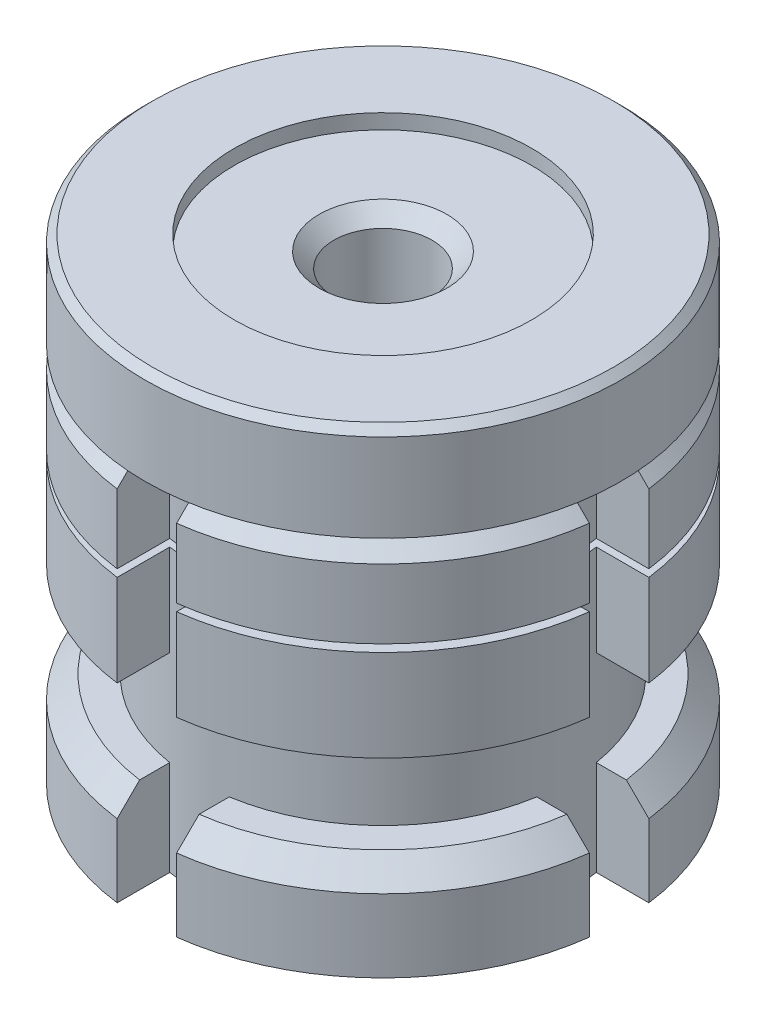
ISO-10303-21;
HEADER;
FILE_DESCRIPTION(('STEP AP214'),'2;1');
FILE_NAME('part.step','',(''),(''),'','','');
FILE_SCHEMA(('AUTOMOTIVE_DESIGN { 1 0 10303 214 1 1 1 1 }'));
ENDSEC;
DATA;
#1=APPLICATION_CONTEXT('core data for automotive mechanical design processes');
#2=APPLICATION_PROTOCOL_DEFINITION('international standard','automotive_design',2000,#1);
#3=PRODUCT_CONTEXT('',#1,'mechanical');
#4=PRODUCT('Part','Part','',(#3));
#5=PRODUCT_RELATED_PRODUCT_CATEGORY('part','',(#4));
#6=PRODUCT_DEFINITION_FORMATION('','',#4);
#7=PRODUCT_DEFINITION_CONTEXT('part definition',#1,'design');
#8=PRODUCT_DEFINITION('design','',#6,#7);
#9=PRODUCT_DEFINITION_SHAPE('','',#8);
#10=(LENGTH_UNIT() NAMED_UNIT(*) SI_UNIT(.MILLI.,.METRE.));
#11=(NAMED_UNIT(*) PLANE_ANGLE_UNIT() SI_UNIT($,.RADIAN.));
#12=(NAMED_UNIT(*) SI_UNIT($,.STERADIAN.) SOLID_ANGLE_UNIT());
#13=UNCERTAINTY_MEASURE_WITH_UNIT(LENGTH_MEASURE(1.E-05),#10,'distance_accuracy_value','');
#14=(GEOMETRIC_REPRESENTATION_CONTEXT(3) GLOBAL_UNCERTAINTY_ASSIGNED_CONTEXT((#13)) GLOBAL_UNIT_ASSIGNED_CONTEXT((#10,
#11,#12)) REPRESENTATION_CONTEXT('',''));
#15=CARTESIAN_POINT('',(0.,0.,0.));
#16=DIRECTION('',(0.,0.,1.));
#17=DIRECTION('',(1.,0.,0.));
#18=AXIS2_PLACEMENT_3D('',#15,#16,#17);
#19=CARTESIAN_POINT('',(0.,12.8,0.));
#20=DIRECTION('',(0.,-1.,0.));
#21=DIRECTION('',(0.,0.,-1.));
#22=AXIS2_PLACEMENT_3D('',#19,#20,#21);
#23=CYLINDRICAL_SURFACE('',#22,16.);
#24=DIRECTION('',(0.,1.,0.));
#25=VECTOR('',#24,1.);
#26=CARTESIAN_POINT('',(-2.00000000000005,-18.2224712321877,15.8745078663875));
#27=LINE('',#26,#25);
#28=CARTESIAN_POINT('',(-2.00000000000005,6.65,15.8745078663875));
#29=VERTEX_POINT('',#28);
#30=CARTESIAN_POINT('',(-2.00000000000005,11.3,15.8745078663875));
#31=VERTEX_POINT('',#30);
#32=EDGE_CURVE('E1102',#29,#31,#27,.T.);
#33=ORIENTED_EDGE('',*,*,#32,.T.);
#34=CARTESIAN_POINT('',(0.,11.3,0.));
#35=DIRECTION('',(0.,1.,0.));
#36=DIRECTION('',(0.,0.,1.));
#37=AXIS2_PLACEMENT_3D('',#34,#35,#36);
#38=CIRCLE('',#37,16.);
#39=CARTESIAN_POINT('',(-15.8745078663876,11.3,1.99999999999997));
#40=VERTEX_POINT('',#39);
#41=EDGE_CURVE('E55',#31,#40,#38,.F.);
#42=ORIENTED_EDGE('',*,*,#41,.T.);
#43=DIRECTION('',(0.,1.,0.));
#44=VECTOR('',#43,1.);
#45=CARTESIAN_POINT('',(-15.8745078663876,-18.2224712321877,1.99999999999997));
#46=LINE('',#45,#44);
#47=CARTESIAN_POINT('',(-15.8745078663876,6.65,1.99999999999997));
#48=VERTEX_POINT('',#47);
#49=EDGE_CURVE('E867',#48,#40,#46,.T.);
#50=ORIENTED_EDGE('',*,*,#49,.F.);
#51=CARTESIAN_POINT('',(0.,6.65,0.));
#52=DIRECTION('',(0.,1.,0.));
#53=DIRECTION('',(0.,0.,1.));
#54=AXIS2_PLACEMENT_3D('',#51,#52,#53);
#55=CIRCLE('',#54,16.);
#56=EDGE_CURVE('E587',#48,#29,#55,.T.);
#57=ORIENTED_EDGE('',*,*,#56,.T.);
#58=EDGE_LOOP('',(#33,#42,#50,#57));
#59=FACE_BOUND('',#58,.T.);
#60=ADVANCED_FACE('F39',(#59),#23,.T.);
#61=DIRECTION('',(0.,1.,0.));
#62=VECTOR('',#61,1.);
#63=CARTESIAN_POINT('',(-15.8745078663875,-18.2224712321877,-2.00000000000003));
#64=LINE('',#63,#62);
#65=CARTESIAN_POINT('',(-15.8745078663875,6.65,-2.00000000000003));
#66=VERTEX_POINT('',#65);
#67=CARTESIAN_POINT('',(-15.8745078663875,11.3,-2.00000000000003));
#68=VERTEX_POINT('',#67);
#69=EDGE_CURVE('E884',#66,#68,#64,.T.);
#70=ORIENTED_EDGE('',*,*,#69,.T.);
#71=CARTESIAN_POINT('',(0.,11.3,0.));
#72=DIRECTION('',(0.,1.,0.));
#73=DIRECTION('',(0.,0.,1.));
#74=AXIS2_PLACEMENT_3D('',#71,#72,#73);
#75=CIRCLE('',#74,16.);
#76=CARTESIAN_POINT('',(-2.00000000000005,11.3,-15.8745078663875));
#77=VERTEX_POINT('',#76);
#78=EDGE_CURVE('E645',#68,#77,#75,.F.);
#79=ORIENTED_EDGE('',*,*,#78,.T.);
#80=DIRECTION('',(0.,1.,0.));
#81=VECTOR('',#80,1.);
#82=CARTESIAN_POINT('',(-2.00000000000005,-18.2224712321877,-15.8745078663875));
#83=LINE('',#82,#81);
#84=CARTESIAN_POINT('',(-2.00000000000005,6.65,-15.8745078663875));
#85=VERTEX_POINT('',#84);
#86=EDGE_CURVE('E463',#85,#77,#83,.T.);
#87=ORIENTED_EDGE('',*,*,#86,.F.);
#88=EDGE_CURVE('E1225',#85,#66,#55,.T.);
#89=ORIENTED_EDGE('',*,*,#88,.T.);
#90=EDGE_LOOP('',(#70,#79,#87,#89));
#91=FACE_BOUND('',#90,.T.);
#92=ADVANCED_FACE('F1242',(#91),#23,.T.);
#93=DIRECTION('',(0.,1.,0.));
#94=VECTOR('',#93,1.);
#95=CARTESIAN_POINT('',(15.8745078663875,-18.2224712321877,2.00000000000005));
#96=LINE('',#95,#94);
#97=CARTESIAN_POINT('',(15.8745078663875,6.65,2.00000000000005));
#98=VERTEX_POINT('',#97);
#99=CARTESIAN_POINT('',(15.8745078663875,11.3,2.00000000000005));
#100=VERTEX_POINT('',#99);
#101=EDGE_CURVE('E1012',#98,#100,#96,.T.);
#102=ORIENTED_EDGE('',*,*,#101,.T.);
#103=CARTESIAN_POINT('',(0.,11.3,0.));
#104=DIRECTION('',(0.,1.,0.));
#105=DIRECTION('',(0.,0.,1.));
#106=AXIS2_PLACEMENT_3D('',#103,#104,#105);
#107=CIRCLE('',#106,16.);
#108=CARTESIAN_POINT('',(2.00000000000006,11.3,15.8745078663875));
#109=VERTEX_POINT('',#108);
#110=EDGE_CURVE('E727',#100,#109,#107,.F.);
#111=ORIENTED_EDGE('',*,*,#110,.T.);
#112=DIRECTION('',(0.,1.,0.));
#113=VECTOR('',#112,1.);
#114=CARTESIAN_POINT('',(2.00000000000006,-18.2224712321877,15.8745078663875));
#115=LINE('',#114,#113);
#116=CARTESIAN_POINT('',(2.00000000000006,6.65,15.8745078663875));
#117=VERTEX_POINT('',#116);
#118=EDGE_CURVE('E1092',#117,#109,#115,.T.);
#119=ORIENTED_EDGE('',*,*,#118,.F.);
#120=EDGE_CURVE('E588',#117,#98,#55,.T.);
#121=ORIENTED_EDGE('',*,*,#120,.T.);
#122=EDGE_LOOP('',(#102,#111,#119,#121));
#123=FACE_BOUND('',#122,.T.);
#124=ADVANCED_FACE('F1090',(#123),#23,.T.);
#125=CARTESIAN_POINT('',(0.,6.65,16.));
#126=DIRECTION('',(0.,1.,0.));
#127=DIRECTION('',(0.,0.,1.));
#128=AXIS2_PLACEMENT_3D('',#125,#126,#127);
#129=PLANE('',#128);
#130=CARTESIAN_POINT('',(0.,6.65,0.));
#131=DIRECTION('',(0.,1.,0.));
#132=DIRECTION('',(0.,0.,1.));
#133=AXIS2_PLACEMENT_3D('',#130,#131,#132);
#134=CIRCLE('',#133,10.);
#135=CARTESIAN_POINT('',(0.,6.65,10.));
#136=VERTEX_POINT('',#135);
#137=EDGE_CURVE('E592',#136,#136,#134,.T.);
#138=ORIENTED_EDGE('',*,*,#137,.T.);
#139=EDGE_LOOP('',(#138));
#140=FACE_BOUND('',#139,.T.);
#141=ORIENTED_EDGE('',*,*,#56,.F.);
#142=DIRECTION('',(1.,0.,0.));
#143=VECTOR('',#142,1.);
#144=CARTESIAN_POINT('',(0.,6.65,1.99999999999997));
#145=LINE('',#144,#143);
#146=CARTESIAN_POINT('',(-12.3389626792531,6.65,1.99999999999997));
#147=VERTEX_POINT('',#146);
#148=EDGE_CURVE('E563',#48,#147,#145,.T.);
#149=ORIENTED_EDGE('',*,*,#148,.T.);
#150=CARTESIAN_POINT('',(0.,6.65,0.));
#151=DIRECTION('',(0.,1.,0.));
#152=DIRECTION('',(0.,0.,1.));
#153=AXIS2_PLACEMENT_3D('',#150,#151,#152);
#154=CIRCLE('',#153,12.5);
#155=CARTESIAN_POINT('',(-12.3389626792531,6.65,-2.00000000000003));
#156=VERTEX_POINT('',#155);
#157=EDGE_CURVE('E547',#147,#156,#154,.F.);
#158=ORIENTED_EDGE('',*,*,#157,.T.);
#159=DIRECTION('',(-1.,0.,0.));
#160=VECTOR('',#159,1.);
#161=CARTESIAN_POINT('',(0.,6.65,-2.00000000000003));
#162=LINE('',#161,#160);
#163=EDGE_CURVE('E540',#156,#66,#162,.T.);
#164=ORIENTED_EDGE('',*,*,#163,.T.);
#165=ORIENTED_EDGE('',*,*,#88,.F.);
#166=DIRECTION('',(0.,0.,1.));
#167=VECTOR('',#166,1.);
#168=CARTESIAN_POINT('',(-2.00000000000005,6.65,16.));
#169=LINE('',#168,#167);
#170=CARTESIAN_POINT('',(-2.00000000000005,6.65,-12.3389626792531));
#171=VERTEX_POINT('',#170);
#172=EDGE_CURVE('E526',#85,#171,#169,.T.);
#173=ORIENTED_EDGE('',*,*,#172,.T.);
#174=CARTESIAN_POINT('',(0.,6.65,0.));
#175=DIRECTION('',(0.,1.,0.));
#176=DIRECTION('',(0.,0.,1.));
#177=AXIS2_PLACEMENT_3D('',#174,#175,#176);
#178=CIRCLE('',#177,12.5);
#179=CARTESIAN_POINT('',(2.00000000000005,6.65,-12.3389626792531));
#180=VERTEX_POINT('',#179);
#181=EDGE_CURVE('E422',#171,#180,#178,.F.);
#182=ORIENTED_EDGE('',*,*,#181,.T.);
#183=DIRECTION('',(0.,0.,-1.));
#184=VECTOR('',#183,1.);
#185=CARTESIAN_POINT('',(2.00000000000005,6.65,16.));
#186=LINE('',#185,#184);
#187=CARTESIAN_POINT('',(2.00000000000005,6.65,-15.8745078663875));
#188=VERTEX_POINT('',#187);
#189=EDGE_CURVE('E499',#180,#188,#186,.T.);
#190=ORIENTED_EDGE('',*,*,#189,.T.);
#191=CARTESIAN_POINT('',(15.8745078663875,6.65,-2.00000000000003));
#192=VERTEX_POINT('',#191);
#193=EDGE_CURVE('E593',#192,#188,#55,.T.);
#194=ORIENTED_EDGE('',*,*,#193,.F.);
#195=DIRECTION('',(-1.,0.,0.));
#196=VECTOR('',#195,1.);
#197=CARTESIAN_POINT('',(0.,6.65,-2.00000000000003));
#198=LINE('',#197,#196);
#199=CARTESIAN_POINT('',(12.3389626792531,6.65,-2.00000000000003));
#200=VERTEX_POINT('',#199);
#201=EDGE_CURVE('E1057',#192,#200,#198,.T.);
#202=ORIENTED_EDGE('',*,*,#201,.T.);
#203=CARTESIAN_POINT('',(0.,6.65,0.));
#204=DIRECTION('',(0.,1.,0.));
#205=DIRECTION('',(0.,0.,1.));
#206=AXIS2_PLACEMENT_3D('',#203,#204,#205);
#207=CIRCLE('',#206,12.5);
#208=CARTESIAN_POINT('',(12.3389626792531,6.65,2.00000000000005));
#209=VERTEX_POINT('',#208);
#210=EDGE_CURVE('E1055',#200,#209,#207,.F.);
#211=ORIENTED_EDGE('',*,*,#210,.T.);
#212=DIRECTION('',(1.,0.,0.));
#213=VECTOR('',#212,1.);
#214=CARTESIAN_POINT('',(0.,6.65,2.00000000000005));
#215=LINE('',#214,#213);
#216=EDGE_CURVE('E985',#209,#98,#215,.T.);
#217=ORIENTED_EDGE('',*,*,#216,.T.);
#218=ORIENTED_EDGE('',*,*,#120,.F.);
#219=DIRECTION('',(0.,0.,-1.));
#220=VECTOR('',#219,1.);
#221=CARTESIAN_POINT('',(2.00000000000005,6.65,16.));
#222=LINE('',#221,#220);
#223=CARTESIAN_POINT('',(2.00000000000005,6.65,12.3389626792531));
#224=VERTEX_POINT('',#223);
#225=EDGE_CURVE('E848',#117,#224,#222,.T.);
#226=ORIENTED_EDGE('',*,*,#225,.T.);
#227=CARTESIAN_POINT('',(0.,6.65,0.));
#228=DIRECTION('',(0.,1.,0.));
#229=DIRECTION('',(0.,0.,1.));
#230=AXIS2_PLACEMENT_3D('',#227,#228,#229);
#231=CIRCLE('',#230,12.5);
#232=CARTESIAN_POINT('',(-2.00000000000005,6.65,12.3389626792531));
#233=VERTEX_POINT('',#232);
#234=EDGE_CURVE('E871',#224,#233,#231,.F.);
#235=ORIENTED_EDGE('',*,*,#234,.T.);
#236=DIRECTION('',(0.,0.,1.));
#237=VECTOR('',#236,1.);
#238=CARTESIAN_POINT('',(-2.00000000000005,6.65,16.));
#239=LINE('',#238,#237);
#240=EDGE_CURVE('E1150',#233,#29,#239,.T.);
#241=ORIENTED_EDGE('',*,*,#240,.T.);
#242=EDGE_LOOP('',(#141,#149,#158,#164,#165,#173,#182,#190,#194,#202,#211,#217,#218,#226,#235,#241));
#243=FACE_BOUND('',#242,.T.);
#244=ADVANCED_FACE('F1061',(#140,#243),#129,.F.);
#245=CARTESIAN_POINT('',(0.,6.15,16.));
#246=DIRECTION('',(0.,-1.,0.));
#247=DIRECTION('',(0.,0.,-1.));
#248=AXIS2_PLACEMENT_3D('',#245,#246,#247);
#249=PLANE('',#248);
#250=CARTESIAN_POINT('',(0.,6.15,0.));
#251=DIRECTION('',(0.,1.,0.));
#252=DIRECTION('',(0.,0.,1.));
#253=AXIS2_PLACEMENT_3D('',#250,#251,#252);
#254=CIRCLE('',#253,10.);
#255=CARTESIAN_POINT('',(0.,6.15,10.));
#256=VERTEX_POINT('',#255);
#257=EDGE_CURVE('E572',#256,#256,#254,.T.);
#258=ORIENTED_EDGE('',*,*,#257,.F.);
#259=EDGE_LOOP('',(#258));
#260=FACE_BOUND('',#259,.T.);
#261=CARTESIAN_POINT('',(0.,6.15,0.));
#262=DIRECTION('',(0.,-1.,0.));
#263=DIRECTION('',(0.,0.,-1.));
#264=AXIS2_PLACEMENT_3D('',#261,#262,#263);
#265=CIRCLE('',#264,12.5);
#266=CARTESIAN_POINT('',(-12.3389626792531,6.15,-2.00000000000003));
#267=VERTEX_POINT('',#266);
#268=CARTESIAN_POINT('',(-12.3389626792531,6.15,1.99999999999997));
#269=VERTEX_POINT('',#268);
#270=EDGE_CURVE('E544',#267,#269,#265,.F.);
#271=ORIENTED_EDGE('',*,*,#270,.T.);
#272=DIRECTION('',(-1.,0.,0.));
#273=VECTOR('',#272,1.);
#274=CARTESIAN_POINT('',(0.,6.15,1.99999999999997));
#275=LINE('',#274,#273);
#276=CARTESIAN_POINT('',(-15.8745078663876,6.15,1.99999999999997));
#277=VERTEX_POINT('',#276);
#278=EDGE_CURVE('E559',#269,#277,#275,.T.);
#279=ORIENTED_EDGE('',*,*,#278,.T.);
#280=CARTESIAN_POINT('',(0.,6.15,0.));
#281=DIRECTION('',(0.,1.,0.));
#282=DIRECTION('',(0.,0.,1.));
#283=AXIS2_PLACEMENT_3D('',#280,#281,#282);
#284=CIRCLE('',#283,16.);
#285=CARTESIAN_POINT('',(-2.00000000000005,6.15,15.8745078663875));
#286=VERTEX_POINT('',#285);
#287=EDGE_CURVE('E582',#277,#286,#284,.T.);
#288=ORIENTED_EDGE('',*,*,#287,.T.);
#289=DIRECTION('',(0.,0.,-1.));
#290=VECTOR('',#289,1.);
#291=CARTESIAN_POINT('',(-2.00000000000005,6.15,16.));
#292=LINE('',#291,#290);
#293=CARTESIAN_POINT('',(-2.00000000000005,6.15,12.3389626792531));
#294=VERTEX_POINT('',#293);
#295=EDGE_CURVE('E1145',#286,#294,#292,.T.);
#296=ORIENTED_EDGE('',*,*,#295,.T.);
#297=CARTESIAN_POINT('',(0.,6.15,0.));
#298=DIRECTION('',(0.,-1.,0.));
#299=DIRECTION('',(0.,0.,-1.));
#300=AXIS2_PLACEMENT_3D('',#297,#298,#299);
#301=CIRCLE('',#300,12.5);
#302=CARTESIAN_POINT('',(2.00000000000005,6.15,12.3389626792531));
#303=VERTEX_POINT('',#302);
#304=EDGE_CURVE('E864',#294,#303,#301,.F.);
#305=ORIENTED_EDGE('',*,*,#304,.T.);
#306=DIRECTION('',(0.,0.,1.));
#307=VECTOR('',#306,1.);
#308=CARTESIAN_POINT('',(2.00000000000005,6.15,16.));
#309=LINE('',#308,#307);
#310=CARTESIAN_POINT('',(2.00000000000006,6.15,15.8745078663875));
#311=VERTEX_POINT('',#310);
#312=EDGE_CURVE('E1142',#303,#311,#309,.T.);
#313=ORIENTED_EDGE('',*,*,#312,.T.);
#314=CARTESIAN_POINT('',(15.8745078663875,6.15,2.00000000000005));
#315=VERTEX_POINT('',#314);
#316=EDGE_CURVE('E583',#311,#315,#284,.T.);
#317=ORIENTED_EDGE('',*,*,#316,.T.);
#318=DIRECTION('',(-1.,0.,0.));
#319=VECTOR('',#318,1.);
#320=CARTESIAN_POINT('',(0.,6.15,2.00000000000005));
#321=LINE('',#320,#319);
#322=CARTESIAN_POINT('',(12.3389626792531,6.15,2.00000000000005));
#323=VERTEX_POINT('',#322);
#324=EDGE_CURVE('E1078',#315,#323,#321,.T.);
#325=ORIENTED_EDGE('',*,*,#324,.T.);
#326=CARTESIAN_POINT('',(0.,6.15,0.));
#327=DIRECTION('',(0.,-1.,0.));
#328=DIRECTION('',(0.,0.,-1.));
#329=AXIS2_PLACEMENT_3D('',#326,#327,#328);
#330=CIRCLE('',#329,12.5);
#331=CARTESIAN_POINT('',(12.3389626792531,6.15,-2.00000000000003));
#332=VERTEX_POINT('',#331);
#333=EDGE_CURVE('E1154',#323,#332,#330,.F.);
#334=ORIENTED_EDGE('',*,*,#333,.T.);
#335=DIRECTION('',(1.,0.,0.));
#336=VECTOR('',#335,1.);
#337=CARTESIAN_POINT('',(0.,6.15,-2.00000000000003));
#338=LINE('',#337,#336);
#339=CARTESIAN_POINT('',(15.8745078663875,6.15,-2.00000000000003));
#340=VERTEX_POINT('',#339);
#341=EDGE_CURVE('E1066',#332,#340,#338,.T.);
#342=ORIENTED_EDGE('',*,*,#341,.T.);
#343=CARTESIAN_POINT('',(2.00000000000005,6.15,-15.8745078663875));
#344=VERTEX_POINT('',#343);
#345=EDGE_CURVE('E497',#340,#344,#284,.T.);
#346=ORIENTED_EDGE('',*,*,#345,.T.);
#347=DIRECTION('',(0.,0.,1.));
#348=VECTOR('',#347,1.);
#349=CARTESIAN_POINT('',(2.00000000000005,6.15,16.));
#350=LINE('',#349,#348);
#351=CARTESIAN_POINT('',(2.00000000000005,6.15,-12.3389626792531));
#352=VERTEX_POINT('',#351);
#353=EDGE_CURVE('E481',#344,#352,#350,.T.);
#354=ORIENTED_EDGE('',*,*,#353,.T.);
#355=CARTESIAN_POINT('',(0.,6.15,0.));
#356=DIRECTION('',(0.,-1.,0.));
#357=DIRECTION('',(0.,0.,-1.));
#358=AXIS2_PLACEMENT_3D('',#355,#356,#357);
#359=CIRCLE('',#358,12.5);
#360=CARTESIAN_POINT('',(-2.00000000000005,6.15,-12.3389626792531));
#361=VERTEX_POINT('',#360);
#362=EDGE_CURVE('E494',#352,#361,#359,.F.);
#363=ORIENTED_EDGE('',*,*,#362,.T.);
#364=DIRECTION('',(0.,0.,-1.));
#365=VECTOR('',#364,1.);
#366=CARTESIAN_POINT('',(-2.00000000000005,6.15,16.));
#367=LINE('',#366,#365);
#368=CARTESIAN_POINT('',(-2.00000000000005,6.15,-15.8745078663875));
#369=VERTEX_POINT('',#368);
#370=EDGE_CURVE('E523',#361,#369,#367,.T.);
#371=ORIENTED_EDGE('',*,*,#370,.T.);
#372=CARTESIAN_POINT('',(-15.8745078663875,6.15,-2.00000000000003));
#373=VERTEX_POINT('',#372);
#374=EDGE_CURVE('E1941',#369,#373,#284,.T.);
#375=ORIENTED_EDGE('',*,*,#374,.T.);
#376=DIRECTION('',(1.,0.,0.));
#377=VECTOR('',#376,1.);
#378=CARTESIAN_POINT('',(0.,6.15,-2.00000000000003));
#379=LINE('',#378,#377);
#380=EDGE_CURVE('E536',#373,#267,#379,.T.);
#381=ORIENTED_EDGE('',*,*,#380,.T.);
#382=EDGE_LOOP('',(#271,#279,#288,#296,#305,#313,#317,#325,#334,#342,#346,#354,#363,#371,#375,#381));
#383=FACE_BOUND('',#382,.T.);
#384=ADVANCED_FACE('F492',(#260,#383),#249,.F.);
#385=CARTESIAN_POINT('',(0.,0.,0.));
#386=DIRECTION('',(0.,1.,0.));
#387=DIRECTION('',(0.,0.,1.));
#388=AXIS2_PLACEMENT_3D('',#385,#386,#387);
#389=PLANE('',#388);
#390=CARTESIAN_POINT('',(0.,0.,0.));
#391=DIRECTION('',(0.,1.,0.));
#392=DIRECTION('',(0.,0.,1.));
#393=AXIS2_PLACEMENT_3D('',#390,#391,#392);
#394=CIRCLE('',#393,16.);
#395=CARTESIAN_POINT('',(-15.8745078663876,0.,1.99999999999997));
#396=VERTEX_POINT('',#395);
#397=CARTESIAN_POINT('',(-2.00000000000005,0.,15.8745078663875));
#398=VERTEX_POINT('',#397);
#399=EDGE_CURVE('E597',#396,#398,#394,.T.);
#400=ORIENTED_EDGE('',*,*,#399,.F.);
#401=DIRECTION('',(1.,0.,0.));
#402=VECTOR('',#401,1.);
#403=CARTESIAN_POINT('',(0.,0.,1.99999999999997));
#404=LINE('',#403,#402);
#405=CARTESIAN_POINT('',(-12.3389626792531,0.,1.99999999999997));
#406=VERTEX_POINT('',#405);
#407=EDGE_CURVE('E555',#396,#406,#404,.T.);
#408=ORIENTED_EDGE('',*,*,#407,.T.);
#409=CARTESIAN_POINT('',(0.,0.,0.));
#410=DIRECTION('',(0.,-1.,0.));
#411=DIRECTION('',(0.,0.,-1.));
#412=AXIS2_PLACEMENT_3D('',#409,#410,#411);
#413=CIRCLE('',#412,12.5);
#414=CARTESIAN_POINT('',(-2.00000000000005,0.,12.3389626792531));
#415=VERTEX_POINT('',#414);
#416=EDGE_CURVE('E1294',#415,#406,#413,.T.);
#417=ORIENTED_EDGE('',*,*,#416,.F.);
#418=DIRECTION('',(0.,0.,1.));
#419=VECTOR('',#418,1.);
#420=CARTESIAN_POINT('',(-2.00000000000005,0.,0.));
#421=LINE('',#420,#419);
#422=EDGE_CURVE('E847',#415,#398,#421,.T.);
#423=ORIENTED_EDGE('',*,*,#422,.T.);
#424=EDGE_LOOP('',(#400,#408,#417,#423));
#425=FACE_BOUND('',#424,.T.);
#426=ADVANCED_FACE('F1257',(#425),#389,.F.);
#427=CARTESIAN_POINT('',(-12.3389626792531,0.,-2.00000000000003));
#428=VERTEX_POINT('',#427);
#429=CARTESIAN_POINT('',(-2.00000000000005,0.,-12.3389626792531));
#430=VERTEX_POINT('',#429);
#431=EDGE_CURVE('E579',#428,#430,#413,.T.);
#432=ORIENTED_EDGE('',*,*,#431,.F.);
#433=DIRECTION('',(-1.,0.,0.));
#434=VECTOR('',#433,1.);
#435=CARTESIAN_POINT('',(0.,0.,-2.00000000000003));
#436=LINE('',#435,#434);
#437=CARTESIAN_POINT('',(-15.8745078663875,0.,-2.00000000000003));
#438=VERTEX_POINT('',#437);
#439=EDGE_CURVE('E532',#428,#438,#436,.T.);
#440=ORIENTED_EDGE('',*,*,#439,.T.);
#441=CARTESIAN_POINT('',(-2.00000000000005,0.,-15.8745078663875));
#442=VERTEX_POINT('',#441);
#443=EDGE_CURVE('E1283',#442,#438,#394,.T.);
#444=ORIENTED_EDGE('',*,*,#443,.F.);
#445=DIRECTION('',(0.,0.,1.));
#446=VECTOR('',#445,1.);
#447=CARTESIAN_POINT('',(-2.00000000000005,0.,0.));
#448=LINE('',#447,#446);
#449=EDGE_CURVE('E519',#442,#430,#448,.T.);
#450=ORIENTED_EDGE('',*,*,#449,.T.);
#451=EDGE_LOOP('',(#432,#440,#444,#450));
#452=FACE_BOUND('',#451,.T.);
#453=ADVANCED_FACE('F1800',(#452),#389,.F.);
#454=CARTESIAN_POINT('',(12.3389626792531,0.,2.00000000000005));
#455=VERTEX_POINT('',#454);
#456=CARTESIAN_POINT('',(2.00000000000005,0.,12.3389626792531));
#457=VERTEX_POINT('',#456);
#458=EDGE_CURVE('E578',#455,#457,#413,.T.);
#459=ORIENTED_EDGE('',*,*,#458,.F.);
#460=DIRECTION('',(1.,0.,0.));
#461=VECTOR('',#460,1.);
#462=CARTESIAN_POINT('',(0.,0.,2.00000000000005));
#463=LINE('',#462,#461);
#464=CARTESIAN_POINT('',(15.8745078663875,0.,2.00000000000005));
#465=VERTEX_POINT('',#464);
#466=EDGE_CURVE('E1068',#455,#465,#463,.T.);
#467=ORIENTED_EDGE('',*,*,#466,.T.);
#468=CARTESIAN_POINT('',(2.00000000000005,0.,15.8745078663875));
#469=VERTEX_POINT('',#468);
#470=EDGE_CURVE('E598',#469,#465,#394,.T.);
#471=ORIENTED_EDGE('',*,*,#470,.F.);
#472=DIRECTION('',(0.,0.,-1.));
#473=VECTOR('',#472,1.);
#474=CARTESIAN_POINT('',(2.00000000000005,0.,0.));
#475=LINE('',#474,#473);
#476=EDGE_CURVE('E1184',#469,#457,#475,.T.);
#477=ORIENTED_EDGE('',*,*,#476,.T.);
#478=EDGE_LOOP('',(#459,#467,#471,#477));
#479=FACE_BOUND('',#478,.T.);
#480=ADVANCED_FACE('F1183',(#479),#389,.F.);
#481=ORIENTED_EDGE('',*,*,#287,.F.);
#482=EDGE_CURVE('E865',#396,#277,#46,.T.);
#483=ORIENTED_EDGE('',*,*,#482,.F.);
#484=ORIENTED_EDGE('',*,*,#399,.T.);
#485=EDGE_CURVE('E1100',#398,#286,#27,.T.);
#486=ORIENTED_EDGE('',*,*,#485,.T.);
#487=EDGE_LOOP('',(#481,#483,#484,#486));
#488=FACE_BOUND('',#487,.T.);
#489=ADVANCED_FACE('F1274',(#488),#23,.T.);
#490=ORIENTED_EDGE('',*,*,#443,.T.);
#491=EDGE_CURVE('E882',#438,#373,#64,.T.);
#492=ORIENTED_EDGE('',*,*,#491,.T.);
#493=ORIENTED_EDGE('',*,*,#374,.F.);
#494=EDGE_CURVE('E946',#442,#369,#83,.T.);
#495=ORIENTED_EDGE('',*,*,#494,.F.);
#496=EDGE_LOOP('',(#490,#492,#493,#495));
#497=FACE_BOUND('',#496,.T.);
#498=ADVANCED_FACE('F1268',(#497),#23,.T.);
#499=ORIENTED_EDGE('',*,*,#470,.T.);
#500=EDGE_CURVE('E1011',#465,#315,#96,.T.);
#501=ORIENTED_EDGE('',*,*,#500,.T.);
#502=ORIENTED_EDGE('',*,*,#316,.F.);
#503=EDGE_CURVE('E1095',#469,#311,#115,.T.);
#504=ORIENTED_EDGE('',*,*,#503,.F.);
#505=EDGE_LOOP('',(#499,#501,#502,#504));
#506=FACE_BOUND('',#505,.T.);
#507=ADVANCED_FACE('F1179',(#506),#23,.T.);
#508=CARTESIAN_POINT('',(0.,-6.4,0.));
#509=DIRECTION('',(0.,-1.,0.));
#510=DIRECTION('',(0.,0.,-1.));
#511=AXIS2_PLACEMENT_3D('',#508,#509,#510);
#512=CYLINDRICAL_SURFACE('',#511,16.);
#513=CARTESIAN_POINT('',(-2.00000000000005,-12.8,15.8745078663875));
#514=VERTEX_POINT('',#513);
#515=CARTESIAN_POINT('',(-2.00000000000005,-7.9,15.8745078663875));
#516=VERTEX_POINT('',#515);
#517=EDGE_CURVE('E858',#514,#516,#27,.T.);
#518=ORIENTED_EDGE('',*,*,#517,.T.);
#519=CARTESIAN_POINT('',(0.,-7.9,0.));
#520=DIRECTION('',(0.,-1.,0.));
#521=DIRECTION('',(0.,0.,-1.));
#522=AXIS2_PLACEMENT_3D('',#519,#520,#521);
#523=CIRCLE('',#522,16.);
#524=CARTESIAN_POINT('',(-15.8745078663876,-7.9,1.99999999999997));
#525=VERTEX_POINT('',#524);
#526=EDGE_CURVE('E775',#516,#525,#523,.T.);
#527=ORIENTED_EDGE('',*,*,#526,.T.);
#528=CARTESIAN_POINT('',(-15.8745078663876,-12.8,1.99999999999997));
#529=VERTEX_POINT('',#528);
#530=EDGE_CURVE('E856',#529,#525,#46,.T.);
#531=ORIENTED_EDGE('',*,*,#530,.F.);
#532=CARTESIAN_POINT('',(0.,-12.8,0.));
#533=DIRECTION('',(0.,-1.,0.));
#534=DIRECTION('',(0.,0.,-1.));
#535=AXIS2_PLACEMENT_3D('',#532,#533,#534);
#536=CIRCLE('',#535,16.);
#537=EDGE_CURVE('E1899',#514,#529,#536,.T.);
#538=ORIENTED_EDGE('',*,*,#537,.F.);
#539=EDGE_LOOP('',(#518,#527,#531,#538));
#540=FACE_BOUND('',#539,.T.);
#541=ADVANCED_FACE('F854',(#540),#512,.T.);
#542=CARTESIAN_POINT('',(-15.8745078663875,-12.8,-2.00000000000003));
#543=VERTEX_POINT('',#542);
#544=CARTESIAN_POINT('',(-15.8745078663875,-7.9,-2.00000000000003));
#545=VERTEX_POINT('',#544);
#546=EDGE_CURVE('E877',#543,#545,#64,.T.);
#547=ORIENTED_EDGE('',*,*,#546,.T.);
#548=CARTESIAN_POINT('',(0.,-7.9,0.));
#549=DIRECTION('',(0.,-1.,0.));
#550=DIRECTION('',(0.,0.,-1.));
#551=AXIS2_PLACEMENT_3D('',#548,#549,#550);
#552=CIRCLE('',#551,16.);
#553=CARTESIAN_POINT('',(-2.00000000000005,-7.9,-15.8745078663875));
#554=VERTEX_POINT('',#553);
#555=EDGE_CURVE('E607',#545,#554,#552,.T.);
#556=ORIENTED_EDGE('',*,*,#555,.T.);
#557=CARTESIAN_POINT('',(-2.00000000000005,-12.8,-15.8745078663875));
#558=VERTEX_POINT('',#557);
#559=EDGE_CURVE('E942',#558,#554,#83,.T.);
#560=ORIENTED_EDGE('',*,*,#559,.F.);
#561=EDGE_CURVE('E567',#543,#558,#536,.T.);
#562=ORIENTED_EDGE('',*,*,#561,.F.);
#563=EDGE_LOOP('',(#547,#556,#560,#562));
#564=FACE_BOUND('',#563,.T.);
#565=ADVANCED_FACE('F1273',(#564),#512,.T.);
#566=CARTESIAN_POINT('',(15.8745078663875,-12.8,2.00000000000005));
#567=VERTEX_POINT('',#566);
#568=CARTESIAN_POINT('',(15.8745078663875,-7.9,2.00000000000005));
#569=VERTEX_POINT('',#568);
#570=EDGE_CURVE('E1006',#567,#569,#96,.T.);
#571=ORIENTED_EDGE('',*,*,#570,.T.);
#572=CARTESIAN_POINT('',(0.,-7.9,0.));
#573=DIRECTION('',(0.,-1.,0.));
#574=DIRECTION('',(0.,0.,-1.));
#575=AXIS2_PLACEMENT_3D('',#572,#573,#574);
#576=CIRCLE('',#575,16.);
#577=CARTESIAN_POINT('',(2.00000000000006,-7.9,15.8745078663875));
#578=VERTEX_POINT('',#577);
#579=EDGE_CURVE('E746',#569,#578,#576,.T.);
#580=ORIENTED_EDGE('',*,*,#579,.T.);
#581=CARTESIAN_POINT('',(2.00000000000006,-12.8,15.8745078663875));
#582=VERTEX_POINT('',#581);
#583=EDGE_CURVE('E1097',#582,#578,#115,.T.);
#584=ORIENTED_EDGE('',*,*,#583,.F.);
#585=EDGE_CURVE('E573',#567,#582,#536,.T.);
#586=ORIENTED_EDGE('',*,*,#585,.F.);
#587=EDGE_LOOP('',(#571,#580,#584,#586));
#588=FACE_BOUND('',#587,.T.);
#589=ADVANCED_FACE('F1255',(#588),#512,.T.);
#590=CARTESIAN_POINT('',(0.,-6.4,0.));
#591=DIRECTION('',(0.,-1.,0.));
#592=DIRECTION('',(0.,0.,-1.));
#593=AXIS2_PLACEMENT_3D('',#590,#591,#592);
#594=PLANE('',#593);
#595=DIRECTION('',(-1.,0.,0.));
#596=VECTOR('',#595,1.);
#597=CARTESIAN_POINT('',(0.,-6.4,1.99999999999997));
#598=LINE('',#597,#596);
#599=CARTESIAN_POINT('',(-12.3389626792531,-6.4,1.99999999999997));
#600=VERTEX_POINT('',#599);
#601=CARTESIAN_POINT('',(-14.3614066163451,-6.4,1.99999999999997));
#602=VERTEX_POINT('',#601);
#603=EDGE_CURVE('E551',#600,#602,#598,.T.);
#604=ORIENTED_EDGE('',*,*,#603,.T.);
#605=CARTESIAN_POINT('',(0.,-6.4,0.));
#606=DIRECTION('',(0.,-1.,0.));
#607=DIRECTION('',(0.,0.,-1.));
#608=AXIS2_PLACEMENT_3D('',#605,#606,#607);
#609=CIRCLE('',#608,14.5);
#610=CARTESIAN_POINT('',(-2.00000000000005,-6.4,14.3614066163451));
#611=VERTEX_POINT('',#610);
#612=EDGE_CURVE('E785',#602,#611,#609,.F.);
#613=ORIENTED_EDGE('',*,*,#612,.T.);
#614=DIRECTION('',(0.,0.,-1.));
#615=VECTOR('',#614,1.);
#616=CARTESIAN_POINT('',(-2.00000000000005,-6.4,0.));
#617=LINE('',#616,#615);
#618=CARTESIAN_POINT('',(-2.00000000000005,-6.4,12.3389626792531));
#619=VERTEX_POINT('',#618);
#620=EDGE_CURVE('E839',#611,#619,#617,.T.);
#621=ORIENTED_EDGE('',*,*,#620,.T.);
#622=CARTESIAN_POINT('',(0.,-6.4,0.));
#623=DIRECTION('',(0.,-1.,0.));
#624=DIRECTION('',(0.,0.,-1.));
#625=AXIS2_PLACEMENT_3D('',#622,#623,#624);
#626=CIRCLE('',#625,12.5);
#627=EDGE_CURVE('E1892',#619,#600,#626,.T.);
#628=ORIENTED_EDGE('',*,*,#627,.T.);
#629=EDGE_LOOP('',(#604,#613,#621,#628));
#630=FACE_BOUND('',#629,.T.);
#631=ADVANCED_FACE('F837',(#630),#594,.F.);
#632=DIRECTION('',(0.,0.,-1.));
#633=VECTOR('',#632,1.);
#634=CARTESIAN_POINT('',(-2.00000000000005,-6.4,0.));
#635=LINE('',#634,#633);
#636=CARTESIAN_POINT('',(-2.00000000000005,-6.4,-12.3389626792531));
#637=VERTEX_POINT('',#636);
#638=CARTESIAN_POINT('',(-2.00000000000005,-6.4,-14.3614066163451));
#639=VERTEX_POINT('',#638);
#640=EDGE_CURVE('E515',#637,#639,#635,.T.);
#641=ORIENTED_EDGE('',*,*,#640,.T.);
#642=CARTESIAN_POINT('',(0.,-6.4,0.));
#643=DIRECTION('',(0.,-1.,0.));
#644=DIRECTION('',(0.,0.,-1.));
#645=AXIS2_PLACEMENT_3D('',#642,#643,#644);
#646=CIRCLE('',#645,14.5);
#647=CARTESIAN_POINT('',(-14.3614066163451,-6.4,-2.00000000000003));
#648=VERTEX_POINT('',#647);
#649=EDGE_CURVE('E620',#639,#648,#646,.F.);
#650=ORIENTED_EDGE('',*,*,#649,.T.);
#651=DIRECTION('',(1.,0.,0.));
#652=VECTOR('',#651,1.);
#653=CARTESIAN_POINT('',(0.,-6.4,-2.00000000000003));
#654=LINE('',#653,#652);
#655=CARTESIAN_POINT('',(-12.3389626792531,-6.4,-2.00000000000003));
#656=VERTEX_POINT('',#655);
#657=EDGE_CURVE('E529',#648,#656,#654,.T.);
#658=ORIENTED_EDGE('',*,*,#657,.T.);
#659=EDGE_CURVE('E577',#656,#637,#626,.T.);
#660=ORIENTED_EDGE('',*,*,#659,.T.);
#661=EDGE_LOOP('',(#641,#650,#658,#660));
#662=FACE_BOUND('',#661,.T.);
#663=ADVANCED_FACE('F1743',(#662),#594,.F.);
#664=DIRECTION('',(0.,0.,1.));
#665=VECTOR('',#664,1.);
#666=CARTESIAN_POINT('',(2.00000000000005,-6.4,0.));
#667=LINE('',#666,#665);
#668=CARTESIAN_POINT('',(2.00000000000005,-6.4,12.3389626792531));
#669=VERTEX_POINT('',#668);
#670=CARTESIAN_POINT('',(2.00000000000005,-6.4,14.3614066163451));
#671=VERTEX_POINT('',#670);
#672=EDGE_CURVE('E1211',#669,#671,#667,.T.);
#673=ORIENTED_EDGE('',*,*,#672,.T.);
#674=CARTESIAN_POINT('',(0.,-6.4,0.));
#675=DIRECTION('',(0.,-1.,0.));
#676=DIRECTION('',(0.,0.,-1.));
#677=AXIS2_PLACEMENT_3D('',#674,#675,#676);
#678=CIRCLE('',#677,14.5);
#679=CARTESIAN_POINT('',(14.3614066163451,-6.4,2.00000000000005));
#680=VERTEX_POINT('',#679);
#681=EDGE_CURVE('E766',#671,#680,#678,.F.);
#682=ORIENTED_EDGE('',*,*,#681,.T.);
#683=DIRECTION('',(-1.,0.,0.));
#684=VECTOR('',#683,1.);
#685=CARTESIAN_POINT('',(0.,-6.4,2.00000000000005));
#686=LINE('',#685,#684);
#687=CARTESIAN_POINT('',(12.3389626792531,-6.4,2.00000000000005));
#688=VERTEX_POINT('',#687);
#689=EDGE_CURVE('E1065',#680,#688,#686,.T.);
#690=ORIENTED_EDGE('',*,*,#689,.T.);
#691=EDGE_CURVE('E608',#688,#669,#626,.T.);
#692=ORIENTED_EDGE('',*,*,#691,.T.);
#693=EDGE_LOOP('',(#673,#682,#690,#692));
#694=FACE_BOUND('',#693,.T.);
#695=ADVANCED_FACE('F1693',(#694),#594,.F.);
#696=CARTESIAN_POINT('',(0.,-12.8,0.));
#697=DIRECTION('',(0.,-1.,0.));
#698=DIRECTION('',(0.,0.,-1.));
#699=AXIS2_PLACEMENT_3D('',#696,#697,#698);
#700=PLANE('',#699);
#701=CARTESIAN_POINT('',(0.,-12.8,0.));
#702=DIRECTION('',(0.,-1.,0.));
#703=DIRECTION('',(0.,0.,-1.));
#704=AXIS2_PLACEMENT_3D('',#701,#702,#703);
#705=CIRCLE('',#704,4.29999999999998);
#706=CARTESIAN_POINT('',(0.,-12.8,-4.29999999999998));
#707=VERTEX_POINT('',#706);
#708=EDGE_CURVE('E1923',#707,#707,#705,.F.);
#709=ORIENTED_EDGE('',*,*,#708,.T.);
#710=EDGE_LOOP('',(#709));
#711=FACE_BOUND('',#710,.T.);
#712=DIRECTION('',(1.,0.,0.));
#713=VECTOR('',#712,1.);
#714=CARTESIAN_POINT('',(-12.3389626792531,-12.8,1.99999999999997));
#715=LINE('',#714,#713);
#716=CARTESIAN_POINT('',(-12.3389626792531,-12.8,1.99999999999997));
#717=VERTEX_POINT('',#716);
#718=EDGE_CURVE('E862',#529,#717,#715,.T.);
#719=ORIENTED_EDGE('',*,*,#718,.T.);
#720=CARTESIAN_POINT('',(0.,-12.8,0.));
#721=DIRECTION('',(0.,-1.,0.));
#722=DIRECTION('',(0.,0.,-1.));
#723=AXIS2_PLACEMENT_3D('',#720,#721,#722);
#724=CIRCLE('',#723,12.5);
#725=CARTESIAN_POINT('',(-12.3389626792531,-12.8,-2.00000000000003));
#726=VERTEX_POINT('',#725);
#727=EDGE_CURVE('E911',#717,#726,#724,.T.);
#728=ORIENTED_EDGE('',*,*,#727,.T.);
#729=DIRECTION('',(-1.,0.,0.));
#730=VECTOR('',#729,1.);
#731=CARTESIAN_POINT('',(-15.8745078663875,-12.8,-2.00000000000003));
#732=LINE('',#731,#730);
#733=EDGE_CURVE('E894',#726,#543,#732,.T.);
#734=ORIENTED_EDGE('',*,*,#733,.T.);
#735=ORIENTED_EDGE('',*,*,#561,.T.);
#736=DIRECTION('',(0.,0.,1.));
#737=VECTOR('',#736,1.);
#738=CARTESIAN_POINT('',(-2.00000000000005,-12.8,-15.8745078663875));
#739=LINE('',#738,#737);
#740=CARTESIAN_POINT('',(-2.00000000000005,-12.8,-12.3389626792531));
#741=VERTEX_POINT('',#740);
#742=EDGE_CURVE('E425',#558,#741,#739,.T.);
#743=ORIENTED_EDGE('',*,*,#742,.T.);
#744=CARTESIAN_POINT('',(0.,-12.8,0.));
#745=DIRECTION('',(0.,-1.,0.));
#746=DIRECTION('',(0.,0.,-1.));
#747=AXIS2_PLACEMENT_3D('',#744,#745,#746);
#748=CIRCLE('',#747,12.5);
#749=CARTESIAN_POINT('',(2.00000000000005,-12.8,-12.3389626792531));
#750=VERTEX_POINT('',#749);
#751=EDGE_CURVE('E439',#741,#750,#748,.T.);
#752=ORIENTED_EDGE('',*,*,#751,.T.);
#753=DIRECTION('',(0.,0.,-1.));
#754=VECTOR('',#753,1.);
#755=CARTESIAN_POINT('',(2.00000000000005,-12.8,-12.3389626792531));
#756=LINE('',#755,#754);
#757=CARTESIAN_POINT('',(2.00000000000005,-12.8,-15.8745078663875));
#758=VERTEX_POINT('',#757);
#759=EDGE_CURVE('E459',#750,#758,#756,.T.);
#760=ORIENTED_EDGE('',*,*,#759,.T.);
#761=CARTESIAN_POINT('',(15.8745078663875,-12.8,-2.00000000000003));
#762=VERTEX_POINT('',#761);
#763=EDGE_CURVE('E568',#758,#762,#536,.T.);
#764=ORIENTED_EDGE('',*,*,#763,.T.);
#765=DIRECTION('',(-1.,0.,0.));
#766=VECTOR('',#765,1.);
#767=CARTESIAN_POINT('',(12.3389626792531,-12.8,-2.00000000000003));
#768=LINE('',#767,#766);
#769=CARTESIAN_POINT('',(12.3389626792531,-12.8,-2.00000000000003));
#770=VERTEX_POINT('',#769);
#771=EDGE_CURVE('E996',#762,#770,#768,.T.);
#772=ORIENTED_EDGE('',*,*,#771,.T.);
#773=CARTESIAN_POINT('',(0.,-12.8,0.));
#774=DIRECTION('',(0.,-1.,0.));
#775=DIRECTION('',(0.,0.,-1.));
#776=AXIS2_PLACEMENT_3D('',#773,#774,#775);
#777=CIRCLE('',#776,12.5);
#778=CARTESIAN_POINT('',(12.3389626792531,-12.8,2.00000000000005));
#779=VERTEX_POINT('',#778);
#780=EDGE_CURVE('E1041',#770,#779,#777,.T.);
#781=ORIENTED_EDGE('',*,*,#780,.T.);
#782=DIRECTION('',(1.,0.,0.));
#783=VECTOR('',#782,1.);
#784=CARTESIAN_POINT('',(15.8745078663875,-12.8,2.00000000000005));
#785=LINE('',#784,#783);
#786=EDGE_CURVE('E1023',#779,#567,#785,.T.);
#787=ORIENTED_EDGE('',*,*,#786,.T.);
#788=ORIENTED_EDGE('',*,*,#585,.T.);
#789=DIRECTION('',(0.,0.,-1.));
#790=VECTOR('',#789,1.);
#791=CARTESIAN_POINT('',(2.00000000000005,-12.8,15.8745078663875));
#792=LINE('',#791,#790);
#793=CARTESIAN_POINT('',(2.00000000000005,-12.8,12.3389626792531));
#794=VERTEX_POINT('',#793);
#795=EDGE_CURVE('E1106',#582,#794,#792,.T.);
#796=ORIENTED_EDGE('',*,*,#795,.T.);
#797=CARTESIAN_POINT('',(0.,-12.8,0.));
#798=DIRECTION('',(0.,-1.,0.));
#799=DIRECTION('',(0.,0.,-1.));
#800=AXIS2_PLACEMENT_3D('',#797,#798,#799);
#801=CIRCLE('',#800,12.5);
#802=CARTESIAN_POINT('',(-2.00000000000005,-12.8,12.3389626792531));
#803=VERTEX_POINT('',#802);
#804=EDGE_CURVE('E1120',#794,#803,#801,.T.);
#805=ORIENTED_EDGE('',*,*,#804,.T.);
#806=DIRECTION('',(0.,0.,1.));
#807=VECTOR('',#806,1.);
#808=CARTESIAN_POINT('',(-2.00000000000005,-12.8,12.3389626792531));
#809=LINE('',#808,#807);
#810=EDGE_CURVE('E1194',#803,#514,#809,.T.);
#811=ORIENTED_EDGE('',*,*,#810,.T.);
#812=ORIENTED_EDGE('',*,*,#537,.T.);
#813=EDGE_LOOP('',(#719,#728,#734,#735,#743,#752,#760,#764,#772,#781,#787,#788,#796,#805,#811,#812));
#814=FACE_BOUND('',#813,.T.);
#815=ADVANCED_FACE('F1265',(#711,#814),#700,.T.);
#816=CARTESIAN_POINT('',(0.,-12.8,0.));
#817=DIRECTION('',(0.,1.,0.));
#818=DIRECTION('',(0.,0.,1.));
#819=AXIS2_PLACEMENT_3D('',#816,#817,#818);
#820=CYLINDRICAL_SURFACE('',#819,12.5);
#821=DIRECTION('',(0.,1.,0.));
#822=VECTOR('',#821,1.);
#823=CARTESIAN_POINT('',(-12.3389626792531,-18.2224712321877,1.99999999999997));
#824=LINE('',#823,#822);
#825=EDGE_CURVE('E913',#717,#600,#824,.T.);
#826=ORIENTED_EDGE('',*,*,#825,.T.);
#827=ORIENTED_EDGE('',*,*,#627,.F.);
#828=DIRECTION('',(0.,1.,0.));
#829=VECTOR('',#828,1.);
#830=CARTESIAN_POINT('',(-2.00000000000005,-18.2224712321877,12.3389626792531));
#831=LINE('',#830,#829);
#832=EDGE_CURVE('E844',#803,#619,#831,.T.);
#833=ORIENTED_EDGE('',*,*,#832,.F.);
#834=ORIENTED_EDGE('',*,*,#804,.F.);
#835=DIRECTION('',(0.,1.,0.));
#836=VECTOR('',#835,1.);
#837=CARTESIAN_POINT('',(2.00000000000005,-18.2224712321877,12.3389626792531));
#838=LINE('',#837,#836);
#839=EDGE_CURVE('E1118',#794,#669,#838,.T.);
#840=ORIENTED_EDGE('',*,*,#839,.T.);
#841=ORIENTED_EDGE('',*,*,#691,.F.);
#842=DIRECTION('',(0.,1.,0.));
#843=VECTOR('',#842,1.);
#844=CARTESIAN_POINT('',(12.3389626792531,-18.2224712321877,2.00000000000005));
#845=LINE('',#844,#843);
#846=EDGE_CURVE('E418',#779,#688,#845,.T.);
#847=ORIENTED_EDGE('',*,*,#846,.F.);
#848=ORIENTED_EDGE('',*,*,#780,.F.);
#849=DIRECTION('',(0.,1.,0.));
#850=VECTOR('',#849,1.);
#851=CARTESIAN_POINT('',(12.3389626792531,-18.2224712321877,-2.00000000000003));
#852=LINE('',#851,#850);
#853=CARTESIAN_POINT('',(12.3389626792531,-6.4,-2.00000000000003));
#854=VERTEX_POINT('',#853);
#855=EDGE_CURVE('E1044',#770,#854,#852,.T.);
#856=ORIENTED_EDGE('',*,*,#855,.T.);
#857=CARTESIAN_POINT('',(2.00000000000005,-6.4,-12.3389626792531));
#858=VERTEX_POINT('',#857);
#859=EDGE_CURVE('E603',#858,#854,#626,.T.);
#860=ORIENTED_EDGE('',*,*,#859,.F.);
#861=DIRECTION('',(0.,1.,0.));
#862=VECTOR('',#861,1.);
#863=CARTESIAN_POINT('',(2.00000000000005,-18.2224712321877,-12.3389626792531));
#864=LINE('',#863,#862);
#865=EDGE_CURVE('E456',#750,#858,#864,.T.);
#866=ORIENTED_EDGE('',*,*,#865,.F.);
#867=ORIENTED_EDGE('',*,*,#751,.F.);
#868=DIRECTION('',(0.,1.,0.));
#869=VECTOR('',#868,1.);
#870=CARTESIAN_POINT('',(-2.00000000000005,-18.2224712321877,-12.3389626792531));
#871=LINE('',#870,#869);
#872=EDGE_CURVE('E427',#741,#637,#871,.T.);
#873=ORIENTED_EDGE('',*,*,#872,.T.);
#874=ORIENTED_EDGE('',*,*,#659,.F.);
#875=DIRECTION('',(0.,1.,0.));
#876=VECTOR('',#875,1.);
#877=CARTESIAN_POINT('',(-12.3389626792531,-18.2224712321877,-2.00000000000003));
#878=LINE('',#877,#876);
#879=EDGE_CURVE('E900',#726,#656,#878,.T.);
#880=ORIENTED_EDGE('',*,*,#879,.F.);
#881=ORIENTED_EDGE('',*,*,#727,.F.);
#882=EDGE_LOOP('',(#826,#827,#833,#834,#840,#841,#847,#848,#856,#860,#866,#867,#873,#874,#880,#881));
#883=FACE_BOUND('',#882,.T.);
#884=ORIENTED_EDGE('',*,*,#416,.T.);
#885=EDGE_CURVE('E919',#406,#269,#824,.T.);
#886=ORIENTED_EDGE('',*,*,#885,.T.);
#887=ORIENTED_EDGE('',*,*,#270,.F.);
#888=EDGE_CURVE('E907',#428,#267,#878,.T.);
#889=ORIENTED_EDGE('',*,*,#888,.F.);
#890=ORIENTED_EDGE('',*,*,#431,.T.);
#891=EDGE_CURVE('E424',#430,#361,#871,.T.);
#892=ORIENTED_EDGE('',*,*,#891,.T.);
#893=ORIENTED_EDGE('',*,*,#362,.F.);
#894=CARTESIAN_POINT('',(2.00000000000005,0.,-12.3389626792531));
#895=VERTEX_POINT('',#894);
#896=EDGE_CURVE('E455',#895,#352,#864,.T.);
#897=ORIENTED_EDGE('',*,*,#896,.F.);
#898=CARTESIAN_POINT('',(12.3389626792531,0.,-2.00000000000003));
#899=VERTEX_POINT('',#898);
#900=EDGE_CURVE('E574',#895,#899,#413,.T.);
#901=ORIENTED_EDGE('',*,*,#900,.T.);
#902=EDGE_CURVE('E1046',#899,#332,#852,.T.);
#903=ORIENTED_EDGE('',*,*,#902,.T.);
#904=ORIENTED_EDGE('',*,*,#333,.F.);
#905=EDGE_CURVE('E1177',#455,#323,#845,.T.);
#906=ORIENTED_EDGE('',*,*,#905,.F.);
#907=ORIENTED_EDGE('',*,*,#458,.T.);
#908=EDGE_CURVE('E1117',#457,#303,#838,.T.);
#909=ORIENTED_EDGE('',*,*,#908,.T.);
#910=ORIENTED_EDGE('',*,*,#304,.F.);
#911=EDGE_CURVE('E1206',#415,#294,#831,.T.);
#912=ORIENTED_EDGE('',*,*,#911,.F.);
#913=EDGE_LOOP('',(#884,#886,#887,#889,#890,#892,#893,#897,#901,#903,#904,#906,#907,#909,#910,#912));
#914=FACE_BOUND('',#913,.T.);
#915=ADVANCED_FACE('F1133',(#883,#914),#820,.T.);
#916=DIRECTION('',(0.,1.,0.));
#917=VECTOR('',#916,1.);
#918=CARTESIAN_POINT('',(2.00000000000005,-18.2224712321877,-15.8745078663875));
#919=LINE('',#918,#917);
#920=CARTESIAN_POINT('',(2.00000000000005,11.3,-15.8745078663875));
#921=VERTEX_POINT('',#920);
#922=EDGE_CURVE('E465',#188,#921,#919,.T.);
#923=ORIENTED_EDGE('',*,*,#922,.T.);
#924=CARTESIAN_POINT('',(0.,11.3,0.));
#925=DIRECTION('',(0.,1.,0.));
#926=DIRECTION('',(0.,0.,1.));
#927=AXIS2_PLACEMENT_3D('',#924,#925,#926);
#928=CIRCLE('',#927,16.);
#929=CARTESIAN_POINT('',(15.8745078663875,11.3,-2.00000000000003));
#930=VERTEX_POINT('',#929);
#931=EDGE_CURVE('E721',#921,#930,#928,.F.);
#932=ORIENTED_EDGE('',*,*,#931,.T.);
#933=DIRECTION('',(0.,1.,0.));
#934=VECTOR('',#933,1.);
#935=CARTESIAN_POINT('',(15.8745078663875,-18.2224712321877,-2.00000000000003));
#936=LINE('',#935,#934);
#937=EDGE_CURVE('E999',#192,#930,#936,.T.);
#938=ORIENTED_EDGE('',*,*,#937,.F.);
#939=ORIENTED_EDGE('',*,*,#193,.T.);
#940=EDGE_LOOP('',(#923,#932,#938,#939));
#941=FACE_BOUND('',#940,.T.);
#942=ADVANCED_FACE('F1232',(#941),#23,.T.);
#943=CARTESIAN_POINT('',(0.,13.2647697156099,0.));
#944=DIRECTION('',(0.,1.,0.));
#945=DIRECTION('',(0.,0.,1.));
#946=AXIS2_PLACEMENT_3D('',#943,#944,#945);
#947=CYLINDRICAL_SURFACE('',#946,10.);
#948=ORIENTED_EDGE('',*,*,#137,.F.);
#949=EDGE_LOOP('',(#948));
#950=FACE_BOUND('',#949,.T.);
#951=ORIENTED_EDGE('',*,*,#257,.T.);
#952=EDGE_LOOP('',(#951));
#953=FACE_BOUND('',#952,.T.);
#954=ADVANCED_FACE('F1256',(#950,#953),#947,.T.);
#955=ORIENTED_EDGE('',*,*,#900,.F.);
#956=DIRECTION('',(0.,0.,-1.));
#957=VECTOR('',#956,1.);
#958=CARTESIAN_POINT('',(2.00000000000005,0.,0.));
#959=LINE('',#958,#957);
#960=CARTESIAN_POINT('',(2.00000000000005,0.,-15.8745078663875));
#961=VERTEX_POINT('',#960);
#962=EDGE_CURVE('E484',#895,#961,#959,.T.);
#963=ORIENTED_EDGE('',*,*,#962,.T.);
#964=CARTESIAN_POINT('',(15.8745078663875,0.,-2.00000000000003));
#965=VERTEX_POINT('',#964);
#966=EDGE_CURVE('E602',#965,#961,#394,.T.);
#967=ORIENTED_EDGE('',*,*,#966,.F.);
#968=DIRECTION('',(-1.,0.,0.));
#969=VECTOR('',#968,1.);
#970=CARTESIAN_POINT('',(0.,0.,-2.00000000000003));
#971=LINE('',#970,#969);
#972=EDGE_CURVE('E1071',#965,#899,#971,.T.);
#973=ORIENTED_EDGE('',*,*,#972,.T.);
#974=EDGE_LOOP('',(#955,#963,#967,#973));
#975=FACE_BOUND('',#974,.T.);
#976=ADVANCED_FACE('F1170',(#975),#389,.F.);
#977=ORIENTED_EDGE('',*,*,#966,.T.);
#978=EDGE_CURVE('E464',#961,#344,#919,.T.);
#979=ORIENTED_EDGE('',*,*,#978,.T.);
#980=ORIENTED_EDGE('',*,*,#345,.F.);
#981=EDGE_CURVE('E997',#965,#340,#936,.T.);
#982=ORIENTED_EDGE('',*,*,#981,.F.);
#983=EDGE_LOOP('',(#977,#979,#980,#982));
#984=FACE_BOUND('',#983,.T.);
#985=ADVANCED_FACE('F1243',(#984),#23,.T.);
#986=CARTESIAN_POINT('',(2.00000000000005,-7.90000000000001,-15.8745078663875));
#987=VERTEX_POINT('',#986);
#988=EDGE_CURVE('E460',#758,#987,#919,.T.);
#989=ORIENTED_EDGE('',*,*,#988,.T.);
#990=CARTESIAN_POINT('',(0.,-7.90000000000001,0.));
#991=DIRECTION('',(0.,-1.,0.));
#992=DIRECTION('',(0.,0.,-1.));
#993=AXIS2_PLACEMENT_3D('',#990,#991,#992);
#994=CIRCLE('',#993,16.);
#995=CARTESIAN_POINT('',(15.8745078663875,-7.90000000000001,-2.00000000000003));
#996=VERTEX_POINT('',#995);
#997=EDGE_CURVE('E689',#987,#996,#994,.T.);
#998=ORIENTED_EDGE('',*,*,#997,.T.);
#999=EDGE_CURVE('E992',#762,#996,#936,.T.);
#1000=ORIENTED_EDGE('',*,*,#999,.F.);
#1001=ORIENTED_EDGE('',*,*,#763,.F.);
#1002=EDGE_LOOP('',(#989,#998,#1000,#1001));
#1003=FACE_BOUND('',#1002,.T.);
#1004=ADVANCED_FACE('F990',(#1003),#512,.T.);
#1005=DIRECTION('',(1.,0.,0.));
#1006=VECTOR('',#1005,1.);
#1007=CARTESIAN_POINT('',(0.,-6.4,-2.00000000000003));
#1008=LINE('',#1007,#1006);
#1009=CARTESIAN_POINT('',(14.3614066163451,-6.4,-2.00000000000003));
#1010=VERTEX_POINT('',#1009);
#1011=EDGE_CURVE('E981',#854,#1010,#1008,.T.);
#1012=ORIENTED_EDGE('',*,*,#1011,.T.);
#1013=CARTESIAN_POINT('',(0.,-6.4,0.));
#1014=DIRECTION('',(0.,-1.,0.));
#1015=DIRECTION('',(0.,0.,-1.));
#1016=AXIS2_PLACEMENT_3D('',#1013,#1014,#1015);
#1017=CIRCLE('',#1016,14.5);
#1018=CARTESIAN_POINT('',(2.00000000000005,-6.4,-14.3614066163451));
#1019=VERTEX_POINT('',#1018);
#1020=EDGE_CURVE('E699',#1010,#1019,#1017,.F.);
#1021=ORIENTED_EDGE('',*,*,#1020,.T.);
#1022=DIRECTION('',(0.,0.,1.));
#1023=VECTOR('',#1022,1.);
#1024=CARTESIAN_POINT('',(2.00000000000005,-6.4,0.));
#1025=LINE('',#1024,#1023);
#1026=EDGE_CURVE('E507',#1019,#858,#1025,.T.);
#1027=ORIENTED_EDGE('',*,*,#1026,.T.);
#1028=ORIENTED_EDGE('',*,*,#859,.T.);
#1029=EDGE_LOOP('',(#1012,#1021,#1027,#1028));
#1030=FACE_BOUND('',#1029,.T.);
#1031=ADVANCED_FACE('F980',(#1030),#594,.F.);
#1032=CARTESIAN_POINT('',(2.00000000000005,-18.2224712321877,15.8745078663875));
#1033=DIRECTION('',(1.,0.,0.));
#1034=DIRECTION('',(0.,0.,-1.));
#1035=AXIS2_PLACEMENT_3D('',#1032,#1033,#1034);
#1036=PLANE('',#1035);
#1037=ORIENTED_EDGE('',*,*,#583,.T.);
#1038=CARTESIAN_POINT('',(2.00000000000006,-7.9,15.8745078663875));
#1039=CARTESIAN_POINT('',(2.00000000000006,-7.64989120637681,15.6224321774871));
#1040=CARTESIAN_POINT('',(2.00000000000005,-7.39983680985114,15.3703025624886));
#1041=CARTESIAN_POINT('',(2.00000000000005,-6.89983680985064,14.8659354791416));
#1042=CARTESIAN_POINT('',(2.00000000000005,-6.64989120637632,14.6136980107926));
#1043=CARTESIAN_POINT('',(2.00000000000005,-6.4,14.3614066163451));
#1044=B_SPLINE_CURVE_WITH_KNOTS('',3,(#1038,#1039,#1040,#1041,#1042,#1043),.UNSPECIFIED.,.F.,
.F.,(4,2,4),(0.,1.06530225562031,2.13060451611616),.UNSPECIFIED.);
#1045=EDGE_CURVE('E760',#578,#671,#1044,.T.);
#1046=ORIENTED_EDGE('',*,*,#1045,.T.);
#1047=ORIENTED_EDGE('',*,*,#672,.F.);
#1048=ORIENTED_EDGE('',*,*,#839,.F.);
#1049=ORIENTED_EDGE('',*,*,#795,.F.);
#1050=EDGE_LOOP('',(#1037,#1046,#1047,#1048,#1049));
#1051=FACE_BOUND('',#1050,.T.);
#1052=ADVANCED_FACE('F756',(#1051),#1036,.F.);
#1053=CARTESIAN_POINT('',(-2.00000000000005,-18.2224712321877,12.3389626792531));
#1054=DIRECTION('',(-1.,0.,0.));
#1055=DIRECTION('',(0.,0.,1.));
#1056=AXIS2_PLACEMENT_3D('',#1053,#1054,#1055);
#1057=PLANE('',#1056);
#1058=ORIENTED_EDGE('',*,*,#620,.F.);
#1059=CARTESIAN_POINT('',(-2.00000000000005,-6.4,14.3614066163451));
#1060=CARTESIAN_POINT('',(-2.00000000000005,-6.64989120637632,14.6136980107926));
#1061=CARTESIAN_POINT('',(-2.00000000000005,-6.89983680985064,14.8659354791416));
#1062=CARTESIAN_POINT('',(-2.00000000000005,-7.39983680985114,15.3703025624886));
#1063=CARTESIAN_POINT('',(-2.00000000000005,-7.64989120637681,15.6224321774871));
#1064=CARTESIAN_POINT('',(-2.00000000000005,-7.9,15.8745078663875));
#1065=B_SPLINE_CURVE_WITH_KNOTS('',3,(#1059,#1060,#1061,#1062,#1063,#1064),.UNSPECIFIED.,.F.,
.F.,(4,2,4),(0.,1.06530226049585,2.13060451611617),.UNSPECIFIED.);
#1066=EDGE_CURVE('E822',#611,#516,#1065,.T.);
#1067=ORIENTED_EDGE('',*,*,#1066,.T.);
#1068=ORIENTED_EDGE('',*,*,#517,.F.);
#1069=ORIENTED_EDGE('',*,*,#810,.F.);
#1070=ORIENTED_EDGE('',*,*,#832,.T.);
#1071=EDGE_LOOP('',(#1058,#1067,#1068,#1069,#1070));
#1072=FACE_BOUND('',#1071,.T.);
#1073=ADVANCED_FACE('F842',(#1072),#1057,.F.);
#1074=CARTESIAN_POINT('',(12.3389626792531,-18.2224712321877,-2.00000000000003));
#1075=DIRECTION('',(0.,0.,-1.));
#1076=DIRECTION('',(-1.,0.,0.));
#1077=AXIS2_PLACEMENT_3D('',#1074,#1075,#1076);
#1078=PLANE('',#1077);
#1079=ORIENTED_EDGE('',*,*,#999,.T.);
#1080=CARTESIAN_POINT('',(15.8745078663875,-7.90000000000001,-2.00000000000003));
#1081=CARTESIAN_POINT('',(15.6224321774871,-7.64989120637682,-2.00000000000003));
#1082=CARTESIAN_POINT('',(15.3703025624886,-7.39983680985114,-2.00000000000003));
#1083=CARTESIAN_POINT('',(14.8659354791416,-6.89983680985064,-2.00000000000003));
#1084=CARTESIAN_POINT('',(14.6136980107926,-6.64989120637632,-2.00000000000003));
#1085=CARTESIAN_POINT('',(14.3614066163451,-6.4,-2.00000000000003));
#1086=B_SPLINE_CURVE_WITH_KNOTS('',3,(#1080,#1081,#1082,#1083,#1084,#1085),.UNSPECIFIED.,.F.,
.F.,(4,2,4),(0.,1.06530225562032,2.13060451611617),.UNSPECIFIED.);
#1087=EDGE_CURVE('E693',#996,#1010,#1086,.T.);
#1088=ORIENTED_EDGE('',*,*,#1087,.T.);
#1089=ORIENTED_EDGE('',*,*,#1011,.F.);
#1090=ORIENTED_EDGE('',*,*,#855,.F.);
#1091=ORIENTED_EDGE('',*,*,#771,.F.);
#1092=EDGE_LOOP('',(#1079,#1088,#1089,#1090,#1091));
#1093=FACE_BOUND('',#1092,.T.);
#1094=ADVANCED_FACE('F708',(#1093),#1078,.F.);
#1095=CARTESIAN_POINT('',(15.8745078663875,-18.2224712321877,2.00000000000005));
#1096=DIRECTION('',(0.,0.,1.));
#1097=DIRECTION('',(1.,0.,0.));
#1098=AXIS2_PLACEMENT_3D('',#1095,#1096,#1097);
#1099=PLANE('',#1098);
#1100=ORIENTED_EDGE('',*,*,#689,.F.);
#1101=CARTESIAN_POINT('',(14.3614066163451,-6.4,2.00000000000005));
#1102=CARTESIAN_POINT('',(14.6136980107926,-6.64989120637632,2.00000000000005));
#1103=CARTESIAN_POINT('',(14.8659354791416,-6.89983680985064,2.00000000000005));
#1104=CARTESIAN_POINT('',(15.3703025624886,-7.39983680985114,2.00000000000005));
#1105=CARTESIAN_POINT('',(15.6224321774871,-7.64989120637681,2.00000000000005));
#1106=CARTESIAN_POINT('',(15.8745078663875,-7.9,2.00000000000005));
#1107=B_SPLINE_CURVE_WITH_KNOTS('',3,(#1101,#1102,#1103,#1104,#1105,#1106),.UNSPECIFIED.,.F.,
.F.,(4,2,4),(0.,1.06530226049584,2.13060451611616),.UNSPECIFIED.);
#1108=EDGE_CURVE('E769',#680,#569,#1107,.T.);
#1109=ORIENTED_EDGE('',*,*,#1108,.T.);
#1110=ORIENTED_EDGE('',*,*,#570,.F.);
#1111=ORIENTED_EDGE('',*,*,#786,.F.);
#1112=ORIENTED_EDGE('',*,*,#846,.T.);
#1113=EDGE_LOOP('',(#1100,#1109,#1110,#1111,#1112));
#1114=FACE_BOUND('',#1113,.T.);
#1115=ADVANCED_FACE('F1518',(#1114),#1099,.F.);
#1116=CARTESIAN_POINT('',(2.00000000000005,-18.2224712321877,-12.3389626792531));
#1117=DIRECTION('',(1.,0.,0.));
#1118=DIRECTION('',(0.,0.,-1.));
#1119=AXIS2_PLACEMENT_3D('',#1116,#1117,#1118);
#1120=PLANE('',#1119);
#1121=ORIENTED_EDGE('',*,*,#1026,.F.);
#1122=CARTESIAN_POINT('',(2.00000000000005,-6.4,-14.3614066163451));
#1123=CARTESIAN_POINT('',(2.00000000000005,-6.64989120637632,-14.6136980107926));
#1124=CARTESIAN_POINT('',(2.00000000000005,-6.89983680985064,-14.8659354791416));
#1125=CARTESIAN_POINT('',(2.00000000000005,-7.39983680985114,-15.3703025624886));
#1126=CARTESIAN_POINT('',(2.00000000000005,-7.64989120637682,-15.6224321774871));
#1127=CARTESIAN_POINT('',(2.00000000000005,-7.90000000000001,-15.8745078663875));
#1128=B_SPLINE_CURVE_WITH_KNOTS('',3,(#1122,#1123,#1124,#1125,#1126,#1127),.UNSPECIFIED.,.F.,
.F.,(4,2,4),(0.,1.06530226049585,2.13060451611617),.UNSPECIFIED.);
#1129=EDGE_CURVE('E968',#1019,#987,#1128,.T.);
#1130=ORIENTED_EDGE('',*,*,#1129,.T.);
#1131=ORIENTED_EDGE('',*,*,#988,.F.);
#1132=ORIENTED_EDGE('',*,*,#759,.F.);
#1133=ORIENTED_EDGE('',*,*,#865,.T.);
#1134=EDGE_LOOP('',(#1121,#1130,#1131,#1132,#1133));
#1135=FACE_BOUND('',#1134,.T.);
#1136=ADVANCED_FACE('F983',(#1135),#1120,.F.);
#1137=CARTESIAN_POINT('',(-2.00000000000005,-18.2224712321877,-15.8745078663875));
#1138=DIRECTION('',(-1.,0.,0.));
#1139=DIRECTION('',(0.,0.,1.));
#1140=AXIS2_PLACEMENT_3D('',#1137,#1138,#1139);
#1141=PLANE('',#1140);
#1142=ORIENTED_EDGE('',*,*,#559,.T.);
#1143=CARTESIAN_POINT('',(-2.00000000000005,-7.9,-15.8745078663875));
#1144=CARTESIAN_POINT('',(-2.00000000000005,-7.64989120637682,-15.6224321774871));
#1145=CARTESIAN_POINT('',(-2.00000000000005,-7.39983680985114,-15.3703025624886));
#1146=CARTESIAN_POINT('',(-2.00000000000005,-6.89983680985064,-14.8659354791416));
#1147=CARTESIAN_POINT('',(-2.00000000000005,-6.64989120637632,-14.6136980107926));
#1148=CARTESIAN_POINT('',(-2.00000000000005,-6.4,-14.3614066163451));
#1149=B_SPLINE_CURVE_WITH_KNOTS('',3,(#1143,#1144,#1145,#1146,#1147,#1148),.UNSPECIFIED.,.F.,
.F.,(4,2,4),(0.,1.06530225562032,2.13060451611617),.UNSPECIFIED.);
#1150=EDGE_CURVE('E612',#554,#639,#1149,.T.);
#1151=ORIENTED_EDGE('',*,*,#1150,.T.);
#1152=ORIENTED_EDGE('',*,*,#640,.F.);
#1153=ORIENTED_EDGE('',*,*,#872,.F.);
#1154=ORIENTED_EDGE('',*,*,#742,.F.);
#1155=EDGE_LOOP('',(#1142,#1151,#1152,#1153,#1154));
#1156=FACE_BOUND('',#1155,.T.);
#1157=ADVANCED_FACE('F632',(#1156),#1141,.F.);
#1158=CARTESIAN_POINT('',(-15.8745078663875,-18.2224712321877,-2.00000000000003));
#1159=DIRECTION('',(0.,0.,-1.));
#1160=DIRECTION('',(-1.,0.,0.));
#1161=AXIS2_PLACEMENT_3D('',#1158,#1159,#1160);
#1162=PLANE('',#1161);
#1163=ORIENTED_EDGE('',*,*,#657,.F.);
#1164=CARTESIAN_POINT('',(-14.3614066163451,-6.4,-2.00000000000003));
#1165=CARTESIAN_POINT('',(-14.6136980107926,-6.64989120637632,-2.00000000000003));
#1166=CARTESIAN_POINT('',(-14.8659354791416,-6.89983680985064,-2.00000000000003));
#1167=CARTESIAN_POINT('',(-15.3703025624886,-7.39983680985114,-2.00000000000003));
#1168=CARTESIAN_POINT('',(-15.6224321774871,-7.64989120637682,-2.00000000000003));
#1169=CARTESIAN_POINT('',(-15.8745078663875,-7.9,-2.00000000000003));
#1170=B_SPLINE_CURVE_WITH_KNOTS('',3,(#1164,#1165,#1166,#1167,#1168,#1169),.UNSPECIFIED.,.F.,
.F.,(4,2,4),(0.,1.06530226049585,2.13060451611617),.UNSPECIFIED.);
#1171=EDGE_CURVE('E684',#648,#545,#1170,.T.);
#1172=ORIENTED_EDGE('',*,*,#1171,.T.);
#1173=ORIENTED_EDGE('',*,*,#546,.F.);
#1174=ORIENTED_EDGE('',*,*,#733,.F.);
#1175=ORIENTED_EDGE('',*,*,#879,.T.);
#1176=EDGE_LOOP('',(#1163,#1172,#1173,#1174,#1175));
#1177=FACE_BOUND('',#1176,.T.);
#1178=ADVANCED_FACE('F679',(#1177),#1162,.F.);
#1179=CARTESIAN_POINT('',(-12.3389626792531,-18.2224712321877,1.99999999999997));
#1180=DIRECTION('',(0.,0.,1.));
#1181=DIRECTION('',(1.,0.,0.));
#1182=AXIS2_PLACEMENT_3D('',#1179,#1180,#1181);
#1183=PLANE('',#1182);
#1184=ORIENTED_EDGE('',*,*,#530,.T.);
#1185=CARTESIAN_POINT('',(-15.8745078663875,-7.9,1.99999999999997));
#1186=CARTESIAN_POINT('',(-15.6224321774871,-7.64989120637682,1.99999999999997));
#1187=CARTESIAN_POINT('',(-15.3703025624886,-7.39983680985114,1.99999999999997));
#1188=CARTESIAN_POINT('',(-14.8659354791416,-6.89983680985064,1.99999999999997));
#1189=CARTESIAN_POINT('',(-14.6136980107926,-6.64989120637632,1.99999999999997));
#1190=CARTESIAN_POINT('',(-14.3614066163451,-6.4,1.99999999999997));
#1191=B_SPLINE_CURVE_WITH_KNOTS('',3,(#1185,#1186,#1187,#1188,#1189,#1190),.UNSPECIFIED.,.F.,
.F.,(4,2,4),(0.,1.06530225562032,2.13060451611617),.UNSPECIFIED.);
#1192=EDGE_CURVE('E779',#525,#602,#1191,.T.);
#1193=ORIENTED_EDGE('',*,*,#1192,.T.);
#1194=ORIENTED_EDGE('',*,*,#603,.F.);
#1195=ORIENTED_EDGE('',*,*,#825,.F.);
#1196=ORIENTED_EDGE('',*,*,#718,.F.);
#1197=EDGE_LOOP('',(#1184,#1193,#1194,#1195,#1196));
#1198=FACE_BOUND('',#1197,.T.);
#1199=ADVANCED_FACE('F796',(#1198),#1183,.F.);
#1200=ORIENTED_EDGE('',*,*,#908,.F.);
#1201=ORIENTED_EDGE('',*,*,#476,.F.);
#1202=ORIENTED_EDGE('',*,*,#503,.T.);
#1203=ORIENTED_EDGE('',*,*,#312,.F.);
#1204=EDGE_LOOP('',(#1200,#1201,#1202,#1203));
#1205=FACE_BOUND('',#1204,.T.);
#1206=ADVANCED_FACE('F755',(#1205),#1036,.F.);
#1207=ORIENTED_EDGE('',*,*,#485,.F.);
#1208=ORIENTED_EDGE('',*,*,#422,.F.);
#1209=ORIENTED_EDGE('',*,*,#911,.T.);
#1210=ORIENTED_EDGE('',*,*,#295,.F.);
#1211=EDGE_LOOP('',(#1207,#1208,#1209,#1210));
#1212=FACE_BOUND('',#1211,.T.);
#1213=ADVANCED_FACE('F1295',(#1212),#1057,.F.);
#1214=ORIENTED_EDGE('',*,*,#902,.F.);
#1215=ORIENTED_EDGE('',*,*,#972,.F.);
#1216=ORIENTED_EDGE('',*,*,#981,.T.);
#1217=ORIENTED_EDGE('',*,*,#341,.F.);
#1218=EDGE_LOOP('',(#1214,#1215,#1216,#1217));
#1219=FACE_BOUND('',#1218,.T.);
#1220=ADVANCED_FACE('F707',(#1219),#1078,.F.);
#1221=ORIENTED_EDGE('',*,*,#500,.F.);
#1222=ORIENTED_EDGE('',*,*,#466,.F.);
#1223=ORIENTED_EDGE('',*,*,#905,.T.);
#1224=ORIENTED_EDGE('',*,*,#324,.F.);
#1225=EDGE_LOOP('',(#1221,#1222,#1223,#1224));
#1226=FACE_BOUND('',#1225,.T.);
#1227=ADVANCED_FACE('F1176',(#1226),#1099,.F.);
#1228=ORIENTED_EDGE('',*,*,#891,.F.);
#1229=ORIENTED_EDGE('',*,*,#449,.F.);
#1230=ORIENTED_EDGE('',*,*,#494,.T.);
#1231=ORIENTED_EDGE('',*,*,#370,.F.);
#1232=EDGE_LOOP('',(#1228,#1229,#1230,#1231));
#1233=FACE_BOUND('',#1232,.T.);
#1234=ADVANCED_FACE('F631',(#1233),#1141,.F.);
#1235=ORIENTED_EDGE('',*,*,#978,.F.);
#1236=ORIENTED_EDGE('',*,*,#962,.F.);
#1237=ORIENTED_EDGE('',*,*,#896,.T.);
#1238=ORIENTED_EDGE('',*,*,#353,.F.);
#1239=EDGE_LOOP('',(#1235,#1236,#1237,#1238));
#1240=FACE_BOUND('',#1239,.T.);
#1241=ADVANCED_FACE('F480',(#1240),#1120,.F.);
#1242=ORIENTED_EDGE('',*,*,#885,.F.);
#1243=ORIENTED_EDGE('',*,*,#407,.F.);
#1244=ORIENTED_EDGE('',*,*,#482,.T.);
#1245=ORIENTED_EDGE('',*,*,#278,.F.);
#1246=EDGE_LOOP('',(#1242,#1243,#1244,#1245));
#1247=FACE_BOUND('',#1246,.T.);
#1248=ADVANCED_FACE('F795',(#1247),#1183,.F.);
#1249=ORIENTED_EDGE('',*,*,#491,.F.);
#1250=ORIENTED_EDGE('',*,*,#439,.F.);
#1251=ORIENTED_EDGE('',*,*,#888,.T.);
#1252=ORIENTED_EDGE('',*,*,#380,.F.);
#1253=EDGE_LOOP('',(#1249,#1250,#1251,#1252));
#1254=FACE_BOUND('',#1253,.T.);
#1255=ADVANCED_FACE('F678',(#1254),#1162,.F.);
#1256=DIRECTION('',(0.,0.,1.));
#1257=VECTOR('',#1256,1.);
#1258=CARTESIAN_POINT('',(-2.00000000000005,12.8,12.3389626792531));
#1259=LINE('',#1258,#1257);
#1260=CARTESIAN_POINT('',(-2.00000000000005,12.8,12.3389626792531));
#1261=VERTEX_POINT('',#1260);
#1262=CARTESIAN_POINT('',(-2.00000000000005,12.8,14.3614066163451));
#1263=VERTEX_POINT('',#1262);
#1264=EDGE_CURVE('E1195',#1261,#1263,#1259,.T.);
#1265=ORIENTED_EDGE('',*,*,#1264,.T.);
#1266=CARTESIAN_POINT('',(-2.00000000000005,12.8,14.3614066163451));
#1267=CARTESIAN_POINT('',(-2.00000000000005,12.5501087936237,14.6136980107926));
#1268=CARTESIAN_POINT('',(-2.00000000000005,12.3001631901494,14.8659354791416));
#1269=CARTESIAN_POINT('',(-2.00000000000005,11.8001631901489,15.3703025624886));
#1270=CARTESIAN_POINT('',(-2.00000000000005,11.5501087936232,15.6224321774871));
#1271=CARTESIAN_POINT('',(-2.00000000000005,11.3,15.8745078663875));
#1272=B_SPLINE_CURVE_WITH_KNOTS('',3,(#1266,#1267,#1268,#1269,#1270,#1271),.UNSPECIFIED.,.F.,
.F.,(4,2,4),(0.,1.06530226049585,2.13060451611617),.UNSPECIFIED.);
#1273=EDGE_CURVE('E63',#1263,#31,#1272,.T.);
#1274=ORIENTED_EDGE('',*,*,#1273,.T.);
#1275=ORIENTED_EDGE('',*,*,#32,.F.);
#1276=ORIENTED_EDGE('',*,*,#240,.F.);
#1277=EDGE_CURVE('E1128',#233,#1261,#831,.T.);
#1278=ORIENTED_EDGE('',*,*,#1277,.T.);
#1279=EDGE_LOOP('',(#1265,#1274,#1275,#1276,#1278));
#1280=FACE_BOUND('',#1279,.T.);
#1281=ADVANCED_FACE('F753',(#1280),#1057,.F.);
#1282=ORIENTED_EDGE('',*,*,#118,.T.);
#1283=CARTESIAN_POINT('',(2.00000000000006,11.3,15.8745078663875));
#1284=CARTESIAN_POINT('',(2.00000000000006,11.5501087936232,15.6224321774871));
#1285=CARTESIAN_POINT('',(2.00000000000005,11.8001631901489,15.3703025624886));
#1286=CARTESIAN_POINT('',(2.00000000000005,12.3001631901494,14.8659354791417));
#1287=CARTESIAN_POINT('',(2.00000000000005,12.5501087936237,14.6136980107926));
#1288=CARTESIAN_POINT('',(2.00000000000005,12.8,14.3614066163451));
#1289=B_SPLINE_CURVE_WITH_KNOTS('',3,(#1283,#1284,#1285,#1286,#1287,#1288),.UNSPECIFIED.,.F.,
.F.,(4,2,4),(0.,1.06530225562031,2.13060451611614),.UNSPECIFIED.);
#1290=CARTESIAN_POINT('',(2.00000000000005,12.8,14.3614066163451));
#1291=VERTEX_POINT('',#1290);
#1292=EDGE_CURVE('E738',#109,#1291,#1289,.T.);
#1293=ORIENTED_EDGE('',*,*,#1292,.T.);
#1294=DIRECTION('',(0.,0.,-1.));
#1295=VECTOR('',#1294,1.);
#1296=CARTESIAN_POINT('',(2.00000000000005,12.8,15.8745078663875));
#1297=LINE('',#1296,#1295);
#1298=CARTESIAN_POINT('',(2.00000000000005,12.8,12.3389626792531));
#1299=VERTEX_POINT('',#1298);
#1300=EDGE_CURVE('E1190',#1291,#1299,#1297,.T.);
#1301=ORIENTED_EDGE('',*,*,#1300,.T.);
#1302=EDGE_CURVE('E1112',#224,#1299,#838,.T.);
#1303=ORIENTED_EDGE('',*,*,#1302,.F.);
#1304=ORIENTED_EDGE('',*,*,#225,.F.);
#1305=EDGE_LOOP('',(#1282,#1293,#1301,#1303,#1304));
#1306=FACE_BOUND('',#1305,.T.);
#1307=ADVANCED_FACE('F748',(#1306),#1036,.F.);
#1308=CARTESIAN_POINT('',(0.,-18.2224712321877,0.));
#1309=DIRECTION('',(0.,1.,0.));
#1310=DIRECTION('',(0.,0.,1.));
#1311=AXIS2_PLACEMENT_3D('',#1308,#1309,#1310);
#1312=CYLINDRICAL_SURFACE('',#1311,12.5);
#1313=ORIENTED_EDGE('',*,*,#1302,.T.);
#1314=CARTESIAN_POINT('',(0.,12.8,0.));
#1315=DIRECTION('',(0.,-1.,0.));
#1316=DIRECTION('',(0.,0.,1.));
#1317=AXIS2_PLACEMENT_3D('',#1314,#1315,#1316);
#1318=CIRCLE('',#1317,12.5);
#1319=EDGE_CURVE('E1198',#1299,#1261,#1318,.T.);
#1320=ORIENTED_EDGE('',*,*,#1319,.T.);
#1321=ORIENTED_EDGE('',*,*,#1277,.F.);
#1322=ORIENTED_EDGE('',*,*,#234,.F.);
#1323=EDGE_LOOP('',(#1313,#1320,#1321,#1322));
#1324=FACE_BOUND('',#1323,.T.);
#1325=ADVANCED_FACE('F752',(#1324),#1312,.T.);
#1326=DIRECTION('',(1.,0.,0.));
#1327=VECTOR('',#1326,1.);
#1328=CARTESIAN_POINT('',(15.8745078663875,12.8,2.00000000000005));
#1329=LINE('',#1328,#1327);
#1330=CARTESIAN_POINT('',(12.3389626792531,12.8,2.00000000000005));
#1331=VERTEX_POINT('',#1330);
#1332=CARTESIAN_POINT('',(14.3614066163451,12.8,2.00000000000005));
#1333=VERTEX_POINT('',#1332);
#1334=EDGE_CURVE('E1036',#1331,#1333,#1329,.T.);
#1335=ORIENTED_EDGE('',*,*,#1334,.T.);
#1336=CARTESIAN_POINT('',(14.3614066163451,12.8,2.00000000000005));
#1337=CARTESIAN_POINT('',(14.6136980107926,12.5501087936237,2.00000000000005));
#1338=CARTESIAN_POINT('',(14.8659354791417,12.3001631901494,2.00000000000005));
#1339=CARTESIAN_POINT('',(15.3703025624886,11.8001631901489,2.00000000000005));
#1340=CARTESIAN_POINT('',(15.6224321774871,11.5501087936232,2.00000000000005));
#1341=CARTESIAN_POINT('',(15.8745078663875,11.3,2.00000000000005));
#1342=B_SPLINE_CURVE_WITH_KNOTS('',3,(#1336,#1337,#1338,#1339,#1340,#1341),.UNSPECIFIED.,.F.,
.F.,(4,2,4),(0.,1.06530226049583,2.13060451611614),.UNSPECIFIED.);
#1343=EDGE_CURVE('E720',#1333,#100,#1342,.T.);
#1344=ORIENTED_EDGE('',*,*,#1343,.T.);
#1345=ORIENTED_EDGE('',*,*,#101,.F.);
#1346=ORIENTED_EDGE('',*,*,#216,.F.);
#1347=EDGE_CURVE('E1043',#209,#1331,#845,.T.);
#1348=ORIENTED_EDGE('',*,*,#1347,.T.);
#1349=EDGE_LOOP('',(#1335,#1344,#1345,#1346,#1348));
#1350=FACE_BOUND('',#1349,.T.);
#1351=ADVANCED_FACE('F705',(#1350),#1099,.F.);
#1352=ORIENTED_EDGE('',*,*,#937,.T.);
#1353=CARTESIAN_POINT('',(15.8745078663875,11.3,-2.00000000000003));
#1354=CARTESIAN_POINT('',(15.6224321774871,11.5501087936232,-2.00000000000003));
#1355=CARTESIAN_POINT('',(15.3703025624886,11.8001631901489,-2.00000000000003));
#1356=CARTESIAN_POINT('',(14.8659354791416,12.3001631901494,-2.00000000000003));
#1357=CARTESIAN_POINT('',(14.6136980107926,12.5501087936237,-2.00000000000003));
#1358=CARTESIAN_POINT('',(14.3614066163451,12.8,-2.00000000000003));
#1359=B_SPLINE_CURVE_WITH_KNOTS('',3,(#1353,#1354,#1355,#1356,#1357,#1358),.UNSPECIFIED.,.F.,
.F.,(4,2,4),(0.,1.06530225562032,2.13060451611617),.UNSPECIFIED.);
#1360=CARTESIAN_POINT('',(14.3614066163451,12.8,-2.00000000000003));
#1361=VERTEX_POINT('',#1360);
#1362=EDGE_CURVE('E713',#930,#1361,#1359,.T.);
#1363=ORIENTED_EDGE('',*,*,#1362,.T.);
#1364=DIRECTION('',(-1.,0.,0.));
#1365=VECTOR('',#1364,1.);
#1366=CARTESIAN_POINT('',(12.3389626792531,12.8,-2.00000000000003));
#1367=LINE('',#1366,#1365);
#1368=CARTESIAN_POINT('',(12.3389626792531,12.8,-2.00000000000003));
#1369=VERTEX_POINT('',#1368);
#1370=EDGE_CURVE('E1029',#1361,#1369,#1367,.T.);
#1371=ORIENTED_EDGE('',*,*,#1370,.T.);
#1372=EDGE_CURVE('E1001',#200,#1369,#852,.T.);
#1373=ORIENTED_EDGE('',*,*,#1372,.F.);
#1374=ORIENTED_EDGE('',*,*,#201,.F.);
#1375=EDGE_LOOP('',(#1352,#1363,#1371,#1373,#1374));
#1376=FACE_BOUND('',#1375,.T.);
#1377=ADVANCED_FACE('F701',(#1376),#1078,.F.);
#1378=CARTESIAN_POINT('',(0.,-18.2224712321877,0.));
#1379=DIRECTION('',(0.,1.,0.));
#1380=DIRECTION('',(0.,0.,1.));
#1381=AXIS2_PLACEMENT_3D('',#1378,#1379,#1380);
#1382=CYLINDRICAL_SURFACE('',#1381,12.5);
#1383=ORIENTED_EDGE('',*,*,#1372,.T.);
#1384=CARTESIAN_POINT('',(0.,12.8,0.));
#1385=DIRECTION('',(0.,-1.,0.));
#1386=DIRECTION('',(0.,0.,1.));
#1387=AXIS2_PLACEMENT_3D('',#1384,#1385,#1386);
#1388=CIRCLE('',#1387,12.5);
#1389=EDGE_CURVE('E1039',#1369,#1331,#1388,.T.);
#1390=ORIENTED_EDGE('',*,*,#1389,.T.);
#1391=ORIENTED_EDGE('',*,*,#1347,.F.);
#1392=ORIENTED_EDGE('',*,*,#210,.F.);
#1393=EDGE_LOOP('',(#1383,#1390,#1391,#1392));
#1394=FACE_BOUND('',#1393,.T.);
#1395=ADVANCED_FACE('F630',(#1394),#1382,.T.);
#1396=ORIENTED_EDGE('',*,*,#86,.T.);
#1397=CARTESIAN_POINT('',(-2.00000000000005,11.3,-15.8745078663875));
#1398=CARTESIAN_POINT('',(-2.00000000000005,11.5501087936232,-15.6224321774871));
#1399=CARTESIAN_POINT('',(-2.00000000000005,11.8001631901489,-15.3703025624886));
#1400=CARTESIAN_POINT('',(-2.00000000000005,12.3001631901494,-14.8659354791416));
#1401=CARTESIAN_POINT('',(-2.00000000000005,12.5501087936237,-14.6136980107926));
#1402=CARTESIAN_POINT('',(-2.00000000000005,12.8,-14.3614066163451));
#1403=B_SPLINE_CURVE_WITH_KNOTS('',3,(#1397,#1398,#1399,#1400,#1401,#1402),.UNSPECIFIED.,.F.,
.F.,(4,2,4),(0.,1.06530225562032,2.13060451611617),.UNSPECIFIED.);
#1404=CARTESIAN_POINT('',(-2.00000000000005,12.8,-14.3614066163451));
#1405=VERTEX_POINT('',#1404);
#1406=EDGE_CURVE('E415',#77,#1405,#1403,.T.);
#1407=ORIENTED_EDGE('',*,*,#1406,.T.);
#1408=DIRECTION('',(0.,0.,1.));
#1409=VECTOR('',#1408,1.);
#1410=CARTESIAN_POINT('',(-2.00000000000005,12.8,-15.8745078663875));
#1411=LINE('',#1410,#1409);
#1412=CARTESIAN_POINT('',(-2.00000000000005,12.8,-12.3389626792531));
#1413=VERTEX_POINT('',#1412);
#1414=EDGE_CURVE('E398',#1405,#1413,#1411,.T.);
#1415=ORIENTED_EDGE('',*,*,#1414,.T.);
#1416=EDGE_CURVE('E412',#171,#1413,#871,.T.);
#1417=ORIENTED_EDGE('',*,*,#1416,.F.);
#1418=ORIENTED_EDGE('',*,*,#172,.F.);
#1419=EDGE_LOOP('',(#1396,#1407,#1415,#1417,#1418));
#1420=FACE_BOUND('',#1419,.T.);
#1421=ADVANCED_FACE('F411',(#1420),#1141,.F.);
#1422=CARTESIAN_POINT('',(0.,-18.2224712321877,0.));
#1423=DIRECTION('',(0.,1.,0.));
#1424=DIRECTION('',(0.,0.,1.));
#1425=AXIS2_PLACEMENT_3D('',#1422,#1423,#1424);
#1426=CYLINDRICAL_SURFACE('',#1425,12.5);
#1427=ORIENTED_EDGE('',*,*,#1416,.T.);
#1428=CARTESIAN_POINT('',(0.,12.8,0.));
#1429=DIRECTION('',(0.,-1.,0.));
#1430=DIRECTION('',(0.,0.,1.));
#1431=AXIS2_PLACEMENT_3D('',#1428,#1429,#1430);
#1432=CIRCLE('',#1431,12.5);
#1433=CARTESIAN_POINT('',(2.00000000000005,12.8,-12.3389626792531));
#1434=VERTEX_POINT('',#1433);
#1435=EDGE_CURVE('E394',#1413,#1434,#1432,.T.);
#1436=ORIENTED_EDGE('',*,*,#1435,.T.);
#1437=EDGE_CURVE('E448',#180,#1434,#864,.T.);
#1438=ORIENTED_EDGE('',*,*,#1437,.F.);
#1439=ORIENTED_EDGE('',*,*,#181,.F.);
#1440=EDGE_LOOP('',(#1427,#1436,#1438,#1439));
#1441=FACE_BOUND('',#1440,.T.);
#1442=ADVANCED_FACE('F420',(#1441),#1426,.T.);
#1443=DIRECTION('',(0.,0.,-1.));
#1444=VECTOR('',#1443,1.);
#1445=CARTESIAN_POINT('',(2.00000000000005,12.8,-12.3389626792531));
#1446=LINE('',#1445,#1444);
#1447=CARTESIAN_POINT('',(2.00000000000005,12.8,-14.3614066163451));
#1448=VERTEX_POINT('',#1447);
#1449=EDGE_CURVE('E401',#1434,#1448,#1446,.T.);
#1450=ORIENTED_EDGE('',*,*,#1449,.T.);
#1451=CARTESIAN_POINT('',(2.00000000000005,12.8,-14.3614066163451));
#1452=CARTESIAN_POINT('',(2.00000000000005,12.5501087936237,-14.6136980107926));
#1453=CARTESIAN_POINT('',(2.00000000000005,12.3001631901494,-14.8659354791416));
#1454=CARTESIAN_POINT('',(2.00000000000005,11.8001631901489,-15.3703025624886));
#1455=CARTESIAN_POINT('',(2.00000000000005,11.5501087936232,-15.6224321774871));
#1456=CARTESIAN_POINT('',(2.00000000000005,11.3,-15.8745078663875));
#1457=B_SPLINE_CURVE_WITH_KNOTS('',3,(#1451,#1452,#1453,#1454,#1455,#1456),.UNSPECIFIED.,.F.,
.F.,(4,2,4),(0.,1.06530226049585,2.13060451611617),.UNSPECIFIED.);
#1458=EDGE_CURVE('E644',#1448,#921,#1457,.T.);
#1459=ORIENTED_EDGE('',*,*,#1458,.T.);
#1460=ORIENTED_EDGE('',*,*,#922,.F.);
#1461=ORIENTED_EDGE('',*,*,#189,.F.);
#1462=ORIENTED_EDGE('',*,*,#1437,.T.);
#1463=EDGE_LOOP('',(#1450,#1459,#1460,#1461,#1462));
#1464=FACE_BOUND('',#1463,.T.);
#1465=ADVANCED_FACE('F793',(#1464),#1120,.F.);
#1466=ORIENTED_EDGE('',*,*,#49,.T.);
#1467=CARTESIAN_POINT('',(-15.8745078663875,11.3,1.99999999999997));
#1468=CARTESIAN_POINT('',(-15.6224321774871,11.5501087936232,1.99999999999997));
#1469=CARTESIAN_POINT('',(-15.3703025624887,11.8001631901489,1.99999999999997));
#1470=CARTESIAN_POINT('',(-14.8659354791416,12.3001631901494,1.99999999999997));
#1471=CARTESIAN_POINT('',(-14.6136980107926,12.5501087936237,1.99999999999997));
#1472=CARTESIAN_POINT('',(-14.3614066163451,12.8,1.99999999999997));
#1473=B_SPLINE_CURVE_WITH_KNOTS('',3,(#1467,#1468,#1469,#1470,#1471,#1472),.UNSPECIFIED.,.F.,
.F.,(4,2,4),(0.,1.06530225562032,2.13060451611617),.UNSPECIFIED.);
#1474=CARTESIAN_POINT('',(-14.3614066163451,12.8,1.99999999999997));
#1475=VERTEX_POINT('',#1474);
#1476=EDGE_CURVE('E800',#40,#1475,#1473,.T.);
#1477=ORIENTED_EDGE('',*,*,#1476,.T.);
#1478=DIRECTION('',(1.,0.,0.));
#1479=VECTOR('',#1478,1.);
#1480=CARTESIAN_POINT('',(-12.3389626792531,12.8,1.99999999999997));
#1481=LINE('',#1480,#1479);
#1482=CARTESIAN_POINT('',(-12.3389626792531,12.8,1.99999999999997));
#1483=VERTEX_POINT('',#1482);
#1484=EDGE_CURVE('E936',#1475,#1483,#1481,.T.);
#1485=ORIENTED_EDGE('',*,*,#1484,.T.);
#1486=EDGE_CURVE('E920',#147,#1483,#824,.T.);
#1487=ORIENTED_EDGE('',*,*,#1486,.F.);
#1488=ORIENTED_EDGE('',*,*,#148,.F.);
#1489=EDGE_LOOP('',(#1466,#1477,#1485,#1487,#1488));
#1490=FACE_BOUND('',#1489,.T.);
#1491=ADVANCED_FACE('F790',(#1490),#1183,.F.);
#1492=CARTESIAN_POINT('',(0.,-18.2224712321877,0.));
#1493=DIRECTION('',(0.,1.,0.));
#1494=DIRECTION('',(0.,0.,1.));
#1495=AXIS2_PLACEMENT_3D('',#1492,#1493,#1494);
#1496=CYLINDRICAL_SURFACE('',#1495,12.5);
#1497=ORIENTED_EDGE('',*,*,#1486,.T.);
#1498=CARTESIAN_POINT('',(0.,12.8,0.));
#1499=DIRECTION('',(0.,-1.,0.));
#1500=DIRECTION('',(0.,0.,1.));
#1501=AXIS2_PLACEMENT_3D('',#1498,#1499,#1500);
#1502=CIRCLE('',#1501,12.5);
#1503=CARTESIAN_POINT('',(-12.3389626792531,12.8,-2.00000000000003));
#1504=VERTEX_POINT('',#1503);
#1505=EDGE_CURVE('E933',#1483,#1504,#1502,.T.);
#1506=ORIENTED_EDGE('',*,*,#1505,.T.);
#1507=EDGE_CURVE('E908',#156,#1504,#878,.T.);
#1508=ORIENTED_EDGE('',*,*,#1507,.F.);
#1509=ORIENTED_EDGE('',*,*,#157,.F.);
#1510=EDGE_LOOP('',(#1497,#1506,#1508,#1509));
#1511=FACE_BOUND('',#1510,.T.);
#1512=ADVANCED_FACE('F676',(#1511),#1496,.T.);
#1513=DIRECTION('',(-1.,0.,0.));
#1514=VECTOR('',#1513,1.);
#1515=CARTESIAN_POINT('',(-15.8745078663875,12.8,-2.00000000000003));
#1516=LINE('',#1515,#1514);
#1517=CARTESIAN_POINT('',(-14.3614066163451,12.8,-2.00000000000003));
#1518=VERTEX_POINT('',#1517);
#1519=EDGE_CURVE('E930',#1504,#1518,#1516,.T.);
#1520=ORIENTED_EDGE('',*,*,#1519,.T.);
#1521=CARTESIAN_POINT('',(-14.3614066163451,12.8,-2.00000000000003));
#1522=CARTESIAN_POINT('',(-14.6136980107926,12.5501087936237,-2.00000000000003));
#1523=CARTESIAN_POINT('',(-14.8659354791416,12.3001631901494,-2.00000000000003));
#1524=CARTESIAN_POINT('',(-15.3703025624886,11.8001631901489,-2.00000000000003));
#1525=CARTESIAN_POINT('',(-15.6224321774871,11.5501087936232,-2.00000000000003));
#1526=CARTESIAN_POINT('',(-15.8745078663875,11.3,-2.00000000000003));
#1527=B_SPLINE_CURVE_WITH_KNOTS('',3,(#1521,#1522,#1523,#1524,#1525,#1526),.UNSPECIFIED.,.F.,
.F.,(4,2,4),(0.,1.06530226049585,2.13060451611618),.UNSPECIFIED.);
#1528=EDGE_CURVE('E662',#1518,#68,#1527,.T.);
#1529=ORIENTED_EDGE('',*,*,#1528,.T.);
#1530=ORIENTED_EDGE('',*,*,#69,.F.);
#1531=ORIENTED_EDGE('',*,*,#163,.F.);
#1532=ORIENTED_EDGE('',*,*,#1507,.T.);
#1533=EDGE_LOOP('',(#1520,#1529,#1530,#1531,#1532));
#1534=FACE_BOUND('',#1533,.T.);
#1535=ADVANCED_FACE('F671',(#1534),#1162,.F.);
#1536=CARTESIAN_POINT('',(0.,-7.9,0.));
#1537=DIRECTION('',(0.,-1.,0.));
#1538=DIRECTION('',(0.,0.,-1.));
#1539=AXIS2_PLACEMENT_3D('',#1536,#1537,#1538);
#1540=CONICAL_SURFACE('',#1539,16.,0.785398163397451);
#1541=ORIENTED_EDGE('',*,*,#1171,.F.);
#1542=ORIENTED_EDGE('',*,*,#649,.F.);
#1543=ORIENTED_EDGE('',*,*,#1150,.F.);
#1544=ORIENTED_EDGE('',*,*,#555,.F.);
#1545=EDGE_LOOP('',(#1541,#1542,#1543,#1544));
#1546=FACE_BOUND('',#1545,.T.);
#1547=ADVANCED_FACE('F622',(#1546),#1540,.T.);
#1548=CARTESIAN_POINT('',(0.,-7.90000000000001,0.));
#1549=DIRECTION('',(0.,-1.,0.));
#1550=DIRECTION('',(0.,0.,-1.));
#1551=AXIS2_PLACEMENT_3D('',#1548,#1549,#1550);
#1552=CONICAL_SURFACE('',#1551,16.,0.785398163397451);
#1553=ORIENTED_EDGE('',*,*,#1129,.F.);
#1554=ORIENTED_EDGE('',*,*,#1020,.F.);
#1555=ORIENTED_EDGE('',*,*,#1087,.F.);
#1556=ORIENTED_EDGE('',*,*,#997,.F.);
#1557=EDGE_LOOP('',(#1553,#1554,#1555,#1556));
#1558=FACE_BOUND('',#1557,.T.);
#1559=ADVANCED_FACE('F656',(#1558),#1552,.T.);
#1560=CARTESIAN_POINT('',(0.,12.8,0.));
#1561=DIRECTION('',(0.,-1.,0.));
#1562=DIRECTION('',(0.,0.,-1.));
#1563=AXIS2_PLACEMENT_3D('',#1560,#1561,#1562);
#1564=CONICAL_SURFACE('',#1563,14.5,0.785398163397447);
#1565=ORIENTED_EDGE('',*,*,#1406,.F.);
#1566=ORIENTED_EDGE('',*,*,#78,.F.);
#1567=ORIENTED_EDGE('',*,*,#1528,.F.);
#1568=CARTESIAN_POINT('',(0.,12.8,0.));
#1569=DIRECTION('',(0.,1.,0.));
#1570=DIRECTION('',(0.,0.,1.));
#1571=AXIS2_PLACEMENT_3D('',#1568,#1569,#1570);
#1572=CIRCLE('',#1571,14.5);
#1573=EDGE_CURVE('E669',#1405,#1518,#1572,.T.);
#1574=ORIENTED_EDGE('',*,*,#1573,.F.);
#1575=EDGE_LOOP('',(#1565,#1566,#1567,#1574));
#1576=FACE_BOUND('',#1575,.T.);
#1577=ADVANCED_FACE('F652',(#1576),#1564,.T.);
#1578=CARTESIAN_POINT('',(0.,12.8,0.));
#1579=DIRECTION('',(0.,-1.,0.));
#1580=DIRECTION('',(0.,0.,-1.));
#1581=AXIS2_PLACEMENT_3D('',#1578,#1579,#1580);
#1582=CONICAL_SURFACE('',#1581,14.5,0.785398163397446);
#1583=ORIENTED_EDGE('',*,*,#1362,.F.);
#1584=ORIENTED_EDGE('',*,*,#931,.F.);
#1585=ORIENTED_EDGE('',*,*,#1458,.F.);
#1586=CARTESIAN_POINT('',(0.,12.8,0.));
#1587=DIRECTION('',(0.,1.,0.));
#1588=DIRECTION('',(0.,0.,1.));
#1589=AXIS2_PLACEMENT_3D('',#1586,#1587,#1588);
#1590=CIRCLE('',#1589,14.5);
#1591=EDGE_CURVE('E956',#1361,#1448,#1590,.T.);
#1592=ORIENTED_EDGE('',*,*,#1591,.F.);
#1593=EDGE_LOOP('',(#1583,#1584,#1585,#1592));
#1594=FACE_BOUND('',#1593,.T.);
#1595=ADVANCED_FACE('F655',(#1594),#1582,.T.);
#1596=CARTESIAN_POINT('',(0.,12.8,0.));
#1597=DIRECTION('',(0.,-1.,0.));
#1598=DIRECTION('',(0.,0.,-1.));
#1599=AXIS2_PLACEMENT_3D('',#1596,#1597,#1598);
#1600=CONICAL_SURFACE('',#1599,14.5,0.785398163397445);
#1601=ORIENTED_EDGE('',*,*,#1292,.F.);
#1602=ORIENTED_EDGE('',*,*,#110,.F.);
#1603=ORIENTED_EDGE('',*,*,#1343,.F.);
#1604=CARTESIAN_POINT('',(0.,12.8,0.));
#1605=DIRECTION('',(0.,1.,0.));
#1606=DIRECTION('',(0.,0.,1.));
#1607=AXIS2_PLACEMENT_3D('',#1604,#1605,#1606);
#1608=CIRCLE('',#1607,14.5);
#1609=EDGE_CURVE('E959',#1291,#1333,#1608,.T.);
#1610=ORIENTED_EDGE('',*,*,#1609,.F.);
#1611=EDGE_LOOP('',(#1601,#1602,#1603,#1610));
#1612=FACE_BOUND('',#1611,.T.);
#1613=ADVANCED_FACE('F729',(#1612),#1600,.T.);
#1614=CARTESIAN_POINT('',(0.,-7.9,0.));
#1615=DIRECTION('',(0.,-1.,0.));
#1616=DIRECTION('',(0.,0.,-1.));
#1617=AXIS2_PLACEMENT_3D('',#1614,#1615,#1616);
#1618=CONICAL_SURFACE('',#1617,16.,0.78539816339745);
#1619=ORIENTED_EDGE('',*,*,#1108,.F.);
#1620=ORIENTED_EDGE('',*,*,#681,.F.);
#1621=ORIENTED_EDGE('',*,*,#1045,.F.);
#1622=ORIENTED_EDGE('',*,*,#579,.F.);
#1623=EDGE_LOOP('',(#1619,#1620,#1621,#1622));
#1624=FACE_BOUND('',#1623,.T.);
#1625=ADVANCED_FACE('F733',(#1624),#1618,.T.);
#1626=CARTESIAN_POINT('',(0.,-7.9,0.));
#1627=DIRECTION('',(0.,-1.,0.));
#1628=DIRECTION('',(0.,0.,-1.));
#1629=AXIS2_PLACEMENT_3D('',#1626,#1627,#1628);
#1630=CONICAL_SURFACE('',#1629,16.,0.785398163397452);
#1631=ORIENTED_EDGE('',*,*,#1066,.F.);
#1632=ORIENTED_EDGE('',*,*,#612,.F.);
#1633=ORIENTED_EDGE('',*,*,#1192,.F.);
#1634=ORIENTED_EDGE('',*,*,#526,.F.);
#1635=EDGE_LOOP('',(#1631,#1632,#1633,#1634));
#1636=FACE_BOUND('',#1635,.T.);
#1637=ADVANCED_FACE('F787',(#1636),#1630,.T.);
#1638=CARTESIAN_POINT('',(0.,12.8,0.));
#1639=DIRECTION('',(0.,-1.,0.));
#1640=DIRECTION('',(0.,0.,-1.));
#1641=AXIS2_PLACEMENT_3D('',#1638,#1639,#1640);
#1642=CONICAL_SURFACE('',#1641,14.5,0.785398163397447);
#1643=ORIENTED_EDGE('',*,*,#1476,.F.);
#1644=ORIENTED_EDGE('',*,*,#41,.F.);
#1645=ORIENTED_EDGE('',*,*,#1273,.F.);
#1646=CARTESIAN_POINT('',(0.,12.8,0.));
#1647=DIRECTION('',(0.,1.,0.));
#1648=DIRECTION('',(0.,0.,1.));
#1649=AXIS2_PLACEMENT_3D('',#1646,#1647,#1648);
#1650=CIRCLE('',#1649,14.5);
#1651=EDGE_CURVE('E965',#1475,#1263,#1650,.T.);
#1652=ORIENTED_EDGE('',*,*,#1651,.F.);
#1653=EDGE_LOOP('',(#1643,#1644,#1645,#1652));
#1654=FACE_BOUND('',#1653,.T.);
#1655=ADVANCED_FACE('F811',(#1654),#1642,.T.);
#1656=CARTESIAN_POINT('',(0.,19.2,0.));
#1657=DIRECTION('',(0.,-1.,0.));
#1658=DIRECTION('',(0.,0.,-1.));
#1659=AXIS2_PLACEMENT_3D('',#1656,#1657,#1658);
#1660=CYLINDRICAL_SURFACE('',#1659,16.);
#1661=CARTESIAN_POINT('',(0.,18.7,0.));
#1662=DIRECTION('',(0.,1.,0.));
#1663=DIRECTION('',(0.,0.,1.));
#1664=AXIS2_PLACEMENT_3D('',#1661,#1662,#1663);
#1665=CIRCLE('',#1664,16.);
#1666=CARTESIAN_POINT('',(0.,18.7,16.));
#1667=VERTEX_POINT('',#1666);
#1668=EDGE_CURVE('E1928',#1667,#1667,#1665,.F.);
#1669=ORIENTED_EDGE('',*,*,#1668,.T.);
#1670=EDGE_LOOP('',(#1669));
#1671=FACE_BOUND('',#1670,.T.);
#1672=CARTESIAN_POINT('',(0.,12.8,0.));
#1673=DIRECTION('',(0.,1.,0.));
#1674=DIRECTION('',(0.,0.,1.));
#1675=AXIS2_PLACEMENT_3D('',#1672,#1673,#1674);
#1676=CIRCLE('',#1675,16.);
#1677=CARTESIAN_POINT('',(0.,12.8,16.));
#1678=VERTEX_POINT('',#1677);
#1679=EDGE_CURVE('E939',#1678,#1678,#1676,.T.);
#1680=ORIENTED_EDGE('',*,*,#1679,.T.);
#1681=EDGE_LOOP('',(#1680));
#1682=FACE_BOUND('',#1681,.T.);
#1683=ADVANCED_FACE('F680',(#1671,#1682),#1660,.T.);
#1684=CARTESIAN_POINT('',(0.,19.2,0.));
#1685=DIRECTION('',(0.,1.,0.));
#1686=DIRECTION('',(0.,0.,1.));
#1687=AXIS2_PLACEMENT_3D('',#1684,#1685,#1686);
#1688=PLANE('',#1687);
#1689=CARTESIAN_POINT('',(0.,19.2,0.));
#1690=DIRECTION('',(0.,1.,0.));
#1691=DIRECTION('',(0.,0.,1.));
#1692=AXIS2_PLACEMENT_3D('',#1689,#1690,#1691);
#1693=CIRCLE('',#1692,10.);
#1694=CARTESIAN_POINT('',(0.,19.2,10.));
#1695=VERTEX_POINT('',#1694);
#1696=EDGE_CURVE('E1905',#1695,#1695,#1693,.T.);
#1697=ORIENTED_EDGE('',*,*,#1696,.F.);
#1698=EDGE_LOOP('',(#1697));
#1699=FACE_BOUND('',#1698,.T.);
#1700=CARTESIAN_POINT('',(0.,19.2,0.));
#1701=DIRECTION('',(0.,1.,0.));
#1702=DIRECTION('',(0.,0.,1.));
#1703=AXIS2_PLACEMENT_3D('',#1700,#1701,#1702);
#1704=CIRCLE('',#1703,15.5);
#1705=CARTESIAN_POINT('',(0.,19.2,15.5));
#1706=VERTEX_POINT('',#1705);
#1707=EDGE_CURVE('E808',#1706,#1706,#1704,.T.);
#1708=ORIENTED_EDGE('',*,*,#1707,.T.);
#1709=EDGE_LOOP('',(#1708));
#1710=FACE_BOUND('',#1709,.T.);
#1711=ADVANCED_FACE('F1361',(#1699,#1710),#1688,.T.);
#1712=CARTESIAN_POINT('',(0.,12.8,0.));
#1713=DIRECTION('',(0.,1.,0.));
#1714=DIRECTION('',(0.,0.,1.));
#1715=AXIS2_PLACEMENT_3D('',#1712,#1713,#1714);
#1716=PLANE('',#1715);
#1717=ORIENTED_EDGE('',*,*,#1414,.F.);
#1718=ORIENTED_EDGE('',*,*,#1573,.T.);
#1719=ORIENTED_EDGE('',*,*,#1519,.F.);
#1720=ORIENTED_EDGE('',*,*,#1505,.F.);
#1721=ORIENTED_EDGE('',*,*,#1484,.F.);
#1722=ORIENTED_EDGE('',*,*,#1651,.T.);
#1723=ORIENTED_EDGE('',*,*,#1264,.F.);
#1724=ORIENTED_EDGE('',*,*,#1319,.F.);
#1725=ORIENTED_EDGE('',*,*,#1300,.F.);
#1726=ORIENTED_EDGE('',*,*,#1609,.T.);
#1727=ORIENTED_EDGE('',*,*,#1334,.F.);
#1728=ORIENTED_EDGE('',*,*,#1389,.F.);
#1729=ORIENTED_EDGE('',*,*,#1370,.F.);
#1730=ORIENTED_EDGE('',*,*,#1591,.T.);
#1731=ORIENTED_EDGE('',*,*,#1449,.F.);
#1732=ORIENTED_EDGE('',*,*,#1435,.F.);
#1733=EDGE_LOOP('',(#1717,#1718,#1719,#1720,#1721,#1722,#1723,#1724,#1725,#1726,#1727,#1728,
#1729,#1730,#1731,#1732));
#1734=FACE_BOUND('',#1733,.T.);
#1735=ORIENTED_EDGE('',*,*,#1679,.F.);
#1736=EDGE_LOOP('',(#1735));
#1737=FACE_BOUND('',#1736,.T.);
#1738=ADVANCED_FACE('F396',(#1734,#1737),#1716,.F.);
#1739=CARTESIAN_POINT('',(0.,19.2,0.));
#1740=DIRECTION('',(0.,-1.,0.));
#1741=DIRECTION('',(0.,0.,-1.));
#1742=AXIS2_PLACEMENT_3D('',#1739,#1740,#1741);
#1743=CONICAL_SURFACE('',#1742,15.5,0.785398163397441);
#1744=ORIENTED_EDGE('',*,*,#1668,.F.);
#1745=EDGE_LOOP('',(#1744));
#1746=FACE_BOUND('',#1745,.T.);
#1747=ORIENTED_EDGE('',*,*,#1707,.F.);
#1748=EDGE_LOOP('',(#1747));
#1749=FACE_BOUND('',#1748,.T.);
#1750=ADVANCED_FACE('F816',(#1746,#1749),#1743,.T.);
#1751=CARTESIAN_POINT('',(0.,18.2,0.));
#1752=DIRECTION('',(0.,1.,0.));
#1753=DIRECTION('',(0.,0.,1.));
#1754=AXIS2_PLACEMENT_3D('',#1751,#1752,#1753);
#1755=CYLINDRICAL_SURFACE('',#1754,10.);
#1756=CARTESIAN_POINT('',(0.,18.2,0.));
#1757=DIRECTION('',(0.,1.,0.));
#1758=DIRECTION('',(0.,0.,1.));
#1759=AXIS2_PLACEMENT_3D('',#1756,#1757,#1758);
#1760=CIRCLE('',#1759,10.);
#1761=CARTESIAN_POINT('',(0.,18.2,10.));
#1762=VERTEX_POINT('',#1761);
#1763=EDGE_CURVE('E1907',#1762,#1762,#1760,.T.);
#1764=ORIENTED_EDGE('',*,*,#1763,.F.);
#1765=EDGE_LOOP('',(#1764));
#1766=FACE_BOUND('',#1765,.T.);
#1767=ORIENTED_EDGE('',*,*,#1696,.T.);
#1768=EDGE_LOOP('',(#1767));
#1769=FACE_BOUND('',#1768,.T.);
#1770=ADVANCED_FACE('F1383',(#1766,#1769),#1755,.F.);
#1771=CARTESIAN_POINT('',(0.,18.2,0.));
#1772=DIRECTION('',(0.,1.,0.));
#1773=DIRECTION('',(0.,0.,1.));
#1774=AXIS2_PLACEMENT_3D('',#1771,#1772,#1773);
#1775=PLANE('',#1774);
#1776=CARTESIAN_POINT('',(0.,18.2,0.));
#1777=DIRECTION('',(0.,1.,0.));
#1778=DIRECTION('',(0.,0.,1.));
#1779=AXIS2_PLACEMENT_3D('',#1776,#1777,#1778);
#1780=CIRCLE('',#1779,4.30000000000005);
#1781=CARTESIAN_POINT('',(0.,18.2,4.30000000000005));
#1782=VERTEX_POINT('',#1781);
#1783=EDGE_CURVE('E11',#1782,#1782,#1780,.F.);
#1784=ORIENTED_EDGE('',*,*,#1783,.T.);
#1785=EDGE_LOOP('',(#1784));
#1786=FACE_BOUND('',#1785,.T.);
#1787=ORIENTED_EDGE('',*,*,#1763,.T.);
#1788=EDGE_LOOP('',(#1787));
#1789=FACE_BOUND('',#1788,.T.);
#1790=ADVANCED_FACE('F1390',(#1786,#1789),#1775,.T.);
#1791=CARTESIAN_POINT('',(0.,-22.1338095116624,0.));
#1792=DIRECTION('',(0.,1.,0.));
#1793=DIRECTION('',(0.,0.,1.));
#1794=AXIS2_PLACEMENT_3D('',#1791,#1792,#1793);
#1795=CYLINDRICAL_SURFACE('',#1794,3.3);
#1796=CARTESIAN_POINT('',(0.,-11.8,0.));
#1797=DIRECTION('',(0.,-1.,0.));
#1798=DIRECTION('',(0.,0.,-1.));
#1799=AXIS2_PLACEMENT_3D('',#1796,#1797,#1798);
#1800=CIRCLE('',#1799,3.3);
#1801=CARTESIAN_POINT('',(0.,-11.8,3.3));
#1802=VERTEX_POINT('',#1801);
#1803=EDGE_CURVE('E48',#1802,#1802,#1800,.T.);
#1804=CARTESIAN_POINT('',(0.,17.2,0.));
#1805=DIRECTION('',(0.,1.,0.));
#1806=DIRECTION('',(0.,0.,1.));
#1807=AXIS2_PLACEMENT_3D('',#1804,#1805,#1806);
#1808=CIRCLE('',#1807,3.3);
#1809=CARTESIAN_POINT('',(0.,17.2,3.3));
#1810=VERTEX_POINT('',#1809);
#1811=EDGE_CURVE('E1920',#1810,#1810,#1808,.T.);
#1812=CARTESIAN_POINT('',(0.,-11.8,3.3));
#1813=CARTESIAN_POINT('',(0.,-11.4979166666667,3.3));
#1814=CARTESIAN_POINT('',(0.,-11.1958333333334,3.3));
#1815=CARTESIAN_POINT('',(0.,-10.5916666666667,3.3));
#1816=CARTESIAN_POINT('',(0.,-10.2895833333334,3.3));
#1817=CARTESIAN_POINT('',(0.,-9.68541666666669,3.3));
#1818=CARTESIAN_POINT('',(0.,-9.38333333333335,3.3));
#1819=CARTESIAN_POINT('',(0.,-8.77916666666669,3.3));
#1820=CARTESIAN_POINT('',(0.,-8.47708333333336,3.3));
#1821=CARTESIAN_POINT('',(0.,-7.87291666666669,3.3));
#1822=CARTESIAN_POINT('',(0.,-7.57083333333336,3.3));
#1823=CARTESIAN_POINT('',(0.,-6.96666666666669,3.3));
#1824=CARTESIAN_POINT('',(0.,-6.66458333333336,3.3));
#1825=CARTESIAN_POINT('',(0.,-6.06041666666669,3.3));
#1826=CARTESIAN_POINT('',(0.,-5.75833333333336,3.3));
#1827=CARTESIAN_POINT('',(0.,-5.1541666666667,3.3));
#1828=CARTESIAN_POINT('',(0.,-4.85208333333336,3.3));
#1829=CARTESIAN_POINT('',(0.,-4.2479166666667,3.3));
#1830=CARTESIAN_POINT('',(0.,-3.94583333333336,3.3));
#1831=CARTESIAN_POINT('',(0.,-3.3416666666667,3.3));
#1832=CARTESIAN_POINT('',(0.,-3.03958333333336,3.3));
#1833=CARTESIAN_POINT('',(0.,-2.4354166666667,3.3));
#1834=CARTESIAN_POINT('',(0.,-2.13333333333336,3.3));
#1835=CARTESIAN_POINT('',(0.,-1.5291666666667,3.3));
#1836=CARTESIAN_POINT('',(0.,-1.22708333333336,3.3));
#1837=CARTESIAN_POINT('',(0.,-0.622916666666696,3.3));
#1838=CARTESIAN_POINT('',(0.,-0.320833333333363,3.3));
#1839=CARTESIAN_POINT('',(0.,0.283333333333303,3.3));
#1840=CARTESIAN_POINT('',(0.,0.585416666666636,3.3));
#1841=CARTESIAN_POINT('',(0.,1.1895833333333,3.3));
#1842=CARTESIAN_POINT('',(0.,1.49166666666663,3.3));
#1843=CARTESIAN_POINT('',(0.,2.0958333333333,3.3));
#1844=CARTESIAN_POINT('',(0.,2.39791666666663,3.3));
#1845=CARTESIAN_POINT('',(0.,3.0020833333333,3.3));
#1846=CARTESIAN_POINT('',(0.,3.30416666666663,3.3));
#1847=CARTESIAN_POINT('',(0.,3.9083333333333,3.3));
#1848=CARTESIAN_POINT('',(0.,4.21041666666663,3.3));
#1849=CARTESIAN_POINT('',(0.,4.8145833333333,3.3));
#1850=CARTESIAN_POINT('',(0.,5.11666666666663,3.3));
#1851=CARTESIAN_POINT('',(0.,5.7208333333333,3.3));
#1852=CARTESIAN_POINT('',(0.,6.02291666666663,3.3));
#1853=CARTESIAN_POINT('',(0.,6.6270833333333,3.3));
#1854=CARTESIAN_POINT('',(0.,6.92916666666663,3.3));
#1855=CARTESIAN_POINT('',(0.,7.5333333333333,3.3));
#1856=CARTESIAN_POINT('',(0.,7.83541666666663,3.3));
#1857=CARTESIAN_POINT('',(0.,8.43958333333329,3.3));
#1858=CARTESIAN_POINT('',(0.,8.74166666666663,3.3));
#1859=CARTESIAN_POINT('',(0.,9.34583333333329,3.3));
#1860=CARTESIAN_POINT('',(0.,9.64791666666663,3.3));
#1861=CARTESIAN_POINT('',(0.,10.2520833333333,3.3));
#1862=CARTESIAN_POINT('',(0.,10.5541666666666,3.3));
#1863=CARTESIAN_POINT('',(0.,11.1583333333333,3.3));
#1864=CARTESIAN_POINT('',(0.,11.4604166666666,3.3));
#1865=CARTESIAN_POINT('',(0.,12.0645833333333,3.3));
#1866=CARTESIAN_POINT('',(0.,12.3666666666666,3.3));
#1867=CARTESIAN_POINT('',(0.,12.9708333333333,3.3));
#1868=CARTESIAN_POINT('',(0.,13.2729166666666,3.3));
#1869=CARTESIAN_POINT('',(0.,13.8770833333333,3.3));
#1870=CARTESIAN_POINT('',(0.,14.1791666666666,3.3));
#1871=CARTESIAN_POINT('',(0.,14.7833333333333,3.3));
#1872=CARTESIAN_POINT('',(0.,15.0854166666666,3.3));
#1873=CARTESIAN_POINT('',(0.,15.6895833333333,3.3));
#1874=CARTESIAN_POINT('',(0.,15.9916666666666,3.3));
#1875=CARTESIAN_POINT('',(0.,16.5958333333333,3.3));
#1876=CARTESIAN_POINT('',(0.,16.8979166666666,3.3));
#1877=CARTESIAN_POINT('',(0.,17.2,3.3));
#1878=B_SPLINE_CURVE_WITH_KNOTS('',3,(#1812,#1813,#1814,#1815,#1816,#1817,#1818,#1819,#1820,
#1821,#1822,#1823,#1824,#1825,#1826,#1827,#1828,#1829,#1830,#1831,#1832,#1833,#1834,#1835,#1836,
#1837,#1838,#1839,#1840,#1841,#1842,#1843,#1844,#1845,#1846,#1847,#1848,#1849,#1850,#1851,#1852,
#1853,#1854,#1855,#1856,#1857,#1858,#1859,#1860,#1861,#1862,#1863,#1864,#1865,#1866,#1867,#1868,
#1869,#1870,#1871,#1872,#1873,#1874,#1875,#1876,#1877),.UNSPECIFIED.,.F.,.F.,(4,2,2,2,2,2,2,2,2,
2,2,2,2,2,2,2,2,2,2,2,2,2,2,2,2,2,2,2,2,2,2,2,4),(0.,0.906249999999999,1.8125,2.71875,3.625,
4.53125,5.4375,6.34374999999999,7.24999999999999,8.15624999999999,9.06249999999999,
9.96874999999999,10.875,11.78125,12.6875,13.59375,14.5,15.40625,16.3125,17.21875,18.125,
19.03125,19.9375,20.84375,21.75,22.65625,23.5625,24.46875,25.375,26.28125,27.1875,28.09375,29.),.UNSPECIFIED.);
#1879=EDGE_CURVE('BSEAM1400',#1802,#1810,#1878,.T.);
#1880=ORIENTED_EDGE('',*,*,#1803,.T.);
#1881=ORIENTED_EDGE('',*,*,#1811,.T.);
#1882=ORIENTED_EDGE('',*,*,#1879,.T.);
#1883=ORIENTED_EDGE('',*,*,#1879,.F.);
#1884=EDGE_LOOP('',(#1880,#1882,#1881,#1883));
#1885=FACE_BOUND('',#1884,.T.);
#1886=ADVANCED_FACE('F1400',(#1885),#1795,.F.);
#1887=CARTESIAN_POINT('',(0.,-12.8,0.));
#1888=DIRECTION('',(0.,-1.,0.));
#1889=DIRECTION('',(0.,0.,-1.));
#1890=AXIS2_PLACEMENT_3D('',#1887,#1888,#1889);
#1891=CONICAL_SURFACE('',#1890,4.29999999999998,0.785398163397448);
#1892=ORIENTED_EDGE('',*,*,#1803,.F.);
#1893=EDGE_LOOP('',(#1892));
#1894=FACE_BOUND('',#1893,.T.);
#1895=ORIENTED_EDGE('',*,*,#708,.F.);
#1896=EDGE_LOOP('',(#1895));
#1897=FACE_BOUND('',#1896,.T.);
#1898=ADVANCED_FACE('F1409',(#1894,#1897),#1891,.F.);
#1899=CARTESIAN_POINT('',(0.,17.2,0.));
#1900=DIRECTION('',(0.,1.,0.));
#1901=DIRECTION('',(0.,0.,1.));
#1902=AXIS2_PLACEMENT_3D('',#1899,#1900,#1901);
#1903=CONICAL_SURFACE('',#1902,3.3,0.785398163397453);
#1904=ORIENTED_EDGE('',*,*,#1783,.F.);
#1905=EDGE_LOOP('',(#1904));
#1906=FACE_BOUND('',#1905,.T.);
#1907=ORIENTED_EDGE('',*,*,#1811,.F.);
#1908=EDGE_LOOP('',(#1907));
#1909=FACE_BOUND('',#1908,.T.);
#1910=ADVANCED_FACE('F41',(#1906,#1909),#1903,.F.);
#1911=CLOSED_SHELL('',(#60,#92,#124,#244,#384,#426,#453,#480,#489,#498,#507,#541,#565,#589,#631,
#663,#695,#815,#915,#942,#954,#976,#985,#1004,#1031,#1052,#1073,#1094,#1115,#1136,#1157,#1178,
#1199,#1206,#1213,#1220,#1227,#1234,#1241,#1248,#1255,#1281,#1307,#1325,#1351,#1377,#1395,#1421,
#1442,#1465,#1491,#1512,#1535,#1547,#1559,#1577,#1595,#1613,#1625,#1637,#1655,#1683,#1711,#1738,
#1750,#1770,#1790,#1886,#1898,#1910));
#1912=MANIFOLD_SOLID_BREP('B2',#1911);
#1913=ADVANCED_BREP_SHAPE_REPRESENTATION('',(#18,#1912),#14);
#1914=SHAPE_DEFINITION_REPRESENTATION(#9,#1913);
ENDSEC;
END-ISO-10303-21;
